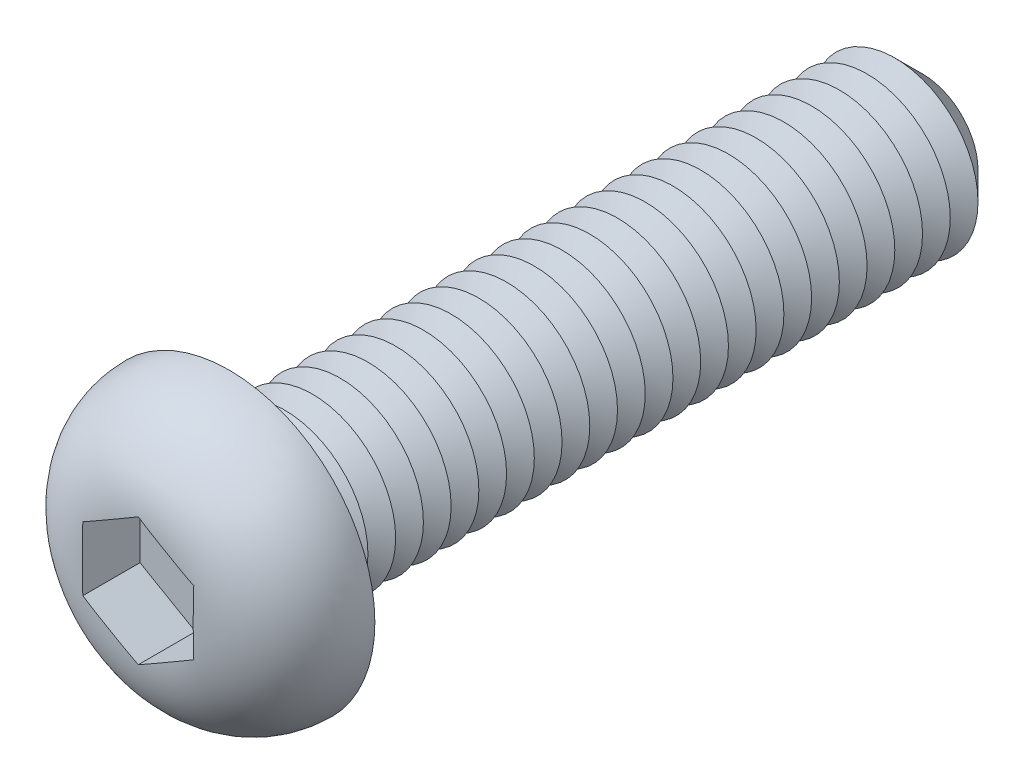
ISO-10303-21;
HEADER;
FILE_DESCRIPTION(('STEP AP214'),'2;1');
FILE_NAME('part.step','',(''),(''),'','','');
FILE_SCHEMA(('AUTOMOTIVE_DESIGN { 1 0 10303 214 1 1 1 1 }'));
ENDSEC;
DATA;
#1=APPLICATION_CONTEXT('core data for automotive mechanical design processes');
#2=APPLICATION_PROTOCOL_DEFINITION('international standard','automotive_design',2000,#1);
#3=PRODUCT_CONTEXT('',#1,'mechanical');
#4=PRODUCT('Part','Part','',(#3));
#5=PRODUCT_RELATED_PRODUCT_CATEGORY('part','',(#4));
#6=PRODUCT_DEFINITION_FORMATION('','',#4);
#7=PRODUCT_DEFINITION_CONTEXT('part definition',#1,'design');
#8=PRODUCT_DEFINITION('design','',#6,#7);
#9=PRODUCT_DEFINITION_SHAPE('','',#8);
#10=(LENGTH_UNIT() NAMED_UNIT(*) SI_UNIT(.MILLI.,.METRE.));
#11=(NAMED_UNIT(*) PLANE_ANGLE_UNIT() SI_UNIT($,.RADIAN.));
#12=(NAMED_UNIT(*) SI_UNIT($,.STERADIAN.) SOLID_ANGLE_UNIT());
#13=UNCERTAINTY_MEASURE_WITH_UNIT(LENGTH_MEASURE(1.E-05),#10,'distance_accuracy_value','');
#14=(GEOMETRIC_REPRESENTATION_CONTEXT(3) GLOBAL_UNCERTAINTY_ASSIGNED_CONTEXT((#13)) GLOBAL_UNIT_ASSIGNED_CONTEXT((#10,
#11,#12)) REPRESENTATION_CONTEXT('',''));
#15=CARTESIAN_POINT('',(0.,0.,0.));
#16=DIRECTION('',(0.,0.,1.));
#17=DIRECTION('',(1.,0.,0.));
#18=AXIS2_PLACEMENT_3D('',#15,#16,#17);
#19=CARTESIAN_POINT('',(0.,0.,-25.));
#20=DIRECTION('',(0.,0.,1.));
#21=DIRECTION('',(1.,0.,0.));
#22=AXIS2_PLACEMENT_3D('',#19,#20,#21);
#23=CYLINDRICAL_SURFACE('',#22,3.);
#24=CARTESIAN_POINT('',(0.,0.,-0.5));
#25=DIRECTION('',(0.,0.,1.));
#26=DIRECTION('',(1.,0.,0.));
#27=AXIS2_PLACEMENT_3D('',#24,#25,#26);
#28=CIRCLE('',#27,3.);
#29=CARTESIAN_POINT('',(3.,0.,-0.5));
#30=VERTEX_POINT('',#29);
#31=EDGE_CURVE('E47',#30,#30,#28,.F.);
#32=ORIENTED_EDGE('',*,*,#31,.T.);
#33=EDGE_LOOP('',(#32));
#34=FACE_BOUND('',#33,.T.);
#35=CARTESIAN_POINT('',(0.,0.,-1.));
#36=DIRECTION('',(0.,0.,1.));
#37=DIRECTION('',(1.,0.,0.));
#38=AXIS2_PLACEMENT_3D('',#35,#36,#37);
#39=CIRCLE('',#38,3.);
#40=CARTESIAN_POINT('',(3.,0.,-1.));
#41=VERTEX_POINT('',#40);
#42=EDGE_CURVE('E117',#41,#41,#39,.T.);
#43=ORIENTED_EDGE('',*,*,#42,.T.);
#44=EDGE_LOOP('',(#43));
#45=FACE_BOUND('',#44,.T.);
#46=ADVANCED_FACE('F38',(#34,#45),#23,.T.);
#47=CARTESIAN_POINT('',(0.,5.25,0.));
#48=DIRECTION('',(0.,0.,1.));
#49=DIRECTION('',(1.,0.,0.));
#50=AXIS2_PLACEMENT_3D('',#47,#48,#49);
#51=PLANE('',#50);
#52=CARTESIAN_POINT('',(0.,0.,0.));
#53=DIRECTION('',(0.,0.,1.));
#54=DIRECTION('',(1.,0.,0.));
#55=AXIS2_PLACEMENT_3D('',#52,#53,#54);
#56=CIRCLE('',#55,3.5);
#57=CARTESIAN_POINT('',(3.5,0.,0.));
#58=VERTEX_POINT('',#57);
#59=EDGE_CURVE('E11',#58,#58,#56,.T.);
#60=ORIENTED_EDGE('',*,*,#59,.T.);
#61=EDGE_LOOP('',(#60));
#62=FACE_BOUND('',#61,.T.);
#63=CARTESIAN_POINT('',(0.,0.,0.));
#64=DIRECTION('',(0.,0.,1.));
#65=DIRECTION('',(1.,0.,0.));
#66=AXIS2_PLACEMENT_3D('',#63,#64,#65);
#67=CIRCLE('',#66,5.25);
#68=CARTESIAN_POINT('',(5.25,0.,0.));
#69=VERTEX_POINT('',#68);
#70=EDGE_CURVE('E141',#69,#69,#67,.T.);
#71=ORIENTED_EDGE('',*,*,#70,.F.);
#72=EDGE_LOOP('',(#71));
#73=FACE_BOUND('',#72,.T.);
#74=ADVANCED_FACE('F218',(#62,#73),#51,.F.);
#75=CARTESIAN_POINT('',(0.,0.,0.));
#76=DIRECTION('',(0.,0.,1.));
#77=DIRECTION('',(1.,0.,0.));
#78=AXIS2_PLACEMENT_3D('',#75,#76,#77);
#79=DEGENERATE_TOROIDAL_SURFACE('',#78,1.95,3.3,.T.);
#80=CARTESIAN_POINT('',(-2.0002,1.15458506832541,3.28035788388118));
#81=CARTESIAN_POINT('',(-1.91691288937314,1.20267090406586,3.28561413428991));
#82=CARTESIAN_POINT('',(-1.83357497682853,1.25078607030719,3.2893341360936));
#83=CARTESIAN_POINT('',(-1.66686712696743,1.34703489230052,3.29467873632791));
#84=CARTESIAN_POINT('',(-1.58349720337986,1.39516854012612,3.29630387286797));
#85=CARTESIAN_POINT('',(-1.4167768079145,1.49142460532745,3.29843721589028));
#86=CARTESIAN_POINT('',(-1.33342633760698,1.53954702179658,3.29894575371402));
#87=CARTESIAN_POINT('',(-1.16671724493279,1.63579656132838,3.29953775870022));
#88=CARTESIAN_POINT('',(-1.0833586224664,1.68392368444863,3.29962119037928));
#89=CARTESIAN_POINT('',(-0.916641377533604,1.78017793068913,3.29962119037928));
#90=CARTESIAN_POINT('',(-0.833282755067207,1.82830505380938,3.29953775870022));
#91=CARTESIAN_POINT('',(-0.666573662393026,1.92455459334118,3.29894575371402));
#92=CARTESIAN_POINT('',(-0.583223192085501,1.97267700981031,3.29843721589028));
#93=CARTESIAN_POINT('',(-0.416502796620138,2.06893307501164,3.29630387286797));
#94=CARTESIAN_POINT('',(-0.333132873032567,2.11706672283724,3.29467873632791));
#95=CARTESIAN_POINT('',(-0.166425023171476,2.21331554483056,3.2893341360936));
#96=CARTESIAN_POINT('',(-0.0830871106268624,2.2614307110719,3.28561413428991));
#97=CARTESIAN_POINT('',(0.000199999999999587,2.30951654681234,3.28035788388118));
#98=B_SPLINE_CURVE_WITH_KNOTS('',3,(#80,#81,#82,#83,#84,#85,#86,#87,#88,#89,#90,#91,#92,#93,#94,
#95,#96,#97),.UNSPECIFIED.,.F.,.F.,(4,2,2,2,2,2,2,2,4),(0.,0.288898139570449,0.577722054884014,
0.866460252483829,1.15522255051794,1.44398484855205,1.73272304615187,2.02154696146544,
2.31044510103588),.UNSPECIFIED.);
#99=CARTESIAN_POINT('',(-2.,1.15470053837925,3.28037053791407));
#100=VERTEX_POINT('',#99);
#101=CARTESIAN_POINT('',(0.,2.3094010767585,3.28037053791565));
#102=VERTEX_POINT('',#101);
#103=EDGE_CURVE('E158',#100,#102,#98,.T.);
#104=ORIENTED_EDGE('',*,*,#103,.T.);
#105=CARTESIAN_POINT('',(-0.000199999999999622,2.30951654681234,3.28035788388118));
#106=CARTESIAN_POINT('',(0.0830871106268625,2.2614307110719,3.28561413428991));
#107=CARTESIAN_POINT('',(0.166425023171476,2.21331554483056,3.2893341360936));
#108=CARTESIAN_POINT('',(0.333132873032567,2.11706672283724,3.29467873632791));
#109=CARTESIAN_POINT('',(0.416502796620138,2.06893307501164,3.29630387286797));
#110=CARTESIAN_POINT('',(0.5832231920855,1.97267700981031,3.29843721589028));
#111=CARTESIAN_POINT('',(0.666573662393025,1.92455459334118,3.29894575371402));
#112=CARTESIAN_POINT('',(0.833282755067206,1.82830505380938,3.29953775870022));
#113=CARTESIAN_POINT('',(0.916641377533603,1.78017793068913,3.29962119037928));
#114=CARTESIAN_POINT('',(1.0833586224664,1.68392368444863,3.29962119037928));
#115=CARTESIAN_POINT('',(1.16671724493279,1.63579656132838,3.29953775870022));
#116=CARTESIAN_POINT('',(1.33342633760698,1.53954702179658,3.29894575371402));
#117=CARTESIAN_POINT('',(1.4167768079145,1.49142460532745,3.29843721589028));
#118=CARTESIAN_POINT('',(1.58349720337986,1.39516854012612,3.29630387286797));
#119=CARTESIAN_POINT('',(1.66686712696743,1.34703489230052,3.29467873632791));
#120=CARTESIAN_POINT('',(1.83357497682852,1.25078607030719,3.2893341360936));
#121=CARTESIAN_POINT('',(1.91691288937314,1.20267090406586,3.28561413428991));
#122=CARTESIAN_POINT('',(2.0002,1.15458506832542,3.28035788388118));
#123=B_SPLINE_CURVE_WITH_KNOTS('',3,(#105,#106,#107,#108,#109,#110,#111,#112,#113,#114,#115,
#116,#117,#118,#119,#120,#121,#122),.UNSPECIFIED.,.F.,.F.,(4,2,2,2,2,2,2,2,4),(0.,
0.288898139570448,0.577722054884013,0.866460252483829,1.15522255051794,1.44398484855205,
1.73272304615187,2.02154696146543,2.31044510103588),.UNSPECIFIED.);
#124=CARTESIAN_POINT('',(2.,1.15470053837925,3.28037053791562));
#125=VERTEX_POINT('',#124);
#126=EDGE_CURVE('E97',#102,#125,#123,.T.);
#127=ORIENTED_EDGE('',*,*,#126,.T.);
#128=CARTESIAN_POINT('',(2.,0.,3.29962119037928));
#129=CARTESIAN_POINT('',(2.,-0.0837769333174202,3.29962202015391));
#130=CARTESIAN_POINT('',(2.,-0.167553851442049,3.29955399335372));
#131=CARTESIAN_POINT('',(2.,-0.335108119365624,3.29913665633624));
#132=CARTESIAN_POINT('',(2.,-0.418885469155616,3.29878734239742));
#133=CARTESIAN_POINT('',(2.,-0.586474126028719,3.29739645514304));
#134=CARTESIAN_POINT('',(2.,-0.670285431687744,3.29635457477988));
#135=CARTESIAN_POINT('',(2.,-0.837881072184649,3.29299045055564));
#136=CARTESIAN_POINT('',(2.,-0.921665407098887,3.29066821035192));
#137=CARTESIAN_POINT('',(2.,-1.1722454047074,3.2807858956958));
#138=CARTESIAN_POINT('',(2.,-1.33895832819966,3.27031526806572));
#139=CARTESIAN_POINT('',(2.,-1.67103623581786,3.23635494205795));
#140=CARTESIAN_POINT('',(2.,-1.83640244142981,3.21287879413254));
#141=CARTESIAN_POINT('',(2.,-2.10344176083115,3.16074182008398));
#142=CARTESIAN_POINT('',(2.,-2.2061099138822,3.13718731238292));
#143=CARTESIAN_POINT('',(2.,-2.40948794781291,3.08263206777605));
#144=CARTESIAN_POINT('',(2.,-2.51019754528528,3.05163026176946));
#145=CARTESIAN_POINT('',(2.,-2.70894468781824,2.98167613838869));
#146=CARTESIAN_POINT('',(2.,-2.80697949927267,2.94271600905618));
#147=CARTESIAN_POINT('',(2.,-2.9994014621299,2.85662314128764));
#148=CARTESIAN_POINT('',(2.,-3.09378880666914,2.80949083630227));
#149=CARTESIAN_POINT('',(2.,-3.27874879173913,2.70660110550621));
#150=CARTESIAN_POINT('',(2.,-3.36928473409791,2.6507774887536));
#151=CARTESIAN_POINT('',(2.,-3.54476824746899,2.53095107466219));
#152=CARTESIAN_POINT('',(2.,-3.6297163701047,2.46694908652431));
#153=CARTESIAN_POINT('',(2.,-3.79309021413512,2.33110056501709));
#154=CARTESIAN_POINT('',(2.,-3.87151694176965,2.25925524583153));
#155=CARTESIAN_POINT('',(2.,-4.02093628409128,2.10826339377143));
#156=CARTESIAN_POINT('',(2.,-4.09192987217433,2.02911781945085));
#157=CARTESIAN_POINT('',(2.,-4.27732278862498,1.8003635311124));
#158=CARTESIAN_POINT('',(2.,-4.38297261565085,1.64348590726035));
#159=CARTESIAN_POINT('',(2.,-4.564185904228,1.31336862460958));
#160=CARTESIAN_POINT('',(2.,-4.63976443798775,1.14013721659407));
#161=CARTESIAN_POINT('',(2.,-4.75417820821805,0.794488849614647));
#162=CARTESIAN_POINT('',(2.,-4.79509243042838,0.622758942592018));
#163=CARTESIAN_POINT('',(2.,-4.84679751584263,0.274828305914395));
#164=CARTESIAN_POINT('',(2.,-4.85759267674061,0.0986282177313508));
#165=CARTESIAN_POINT('',(2.,-4.8487955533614,-0.249157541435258));
#166=CARTESIAN_POINT('',(2.,-4.82985906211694,-0.42076022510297));
#167=CARTESIAN_POINT('',(2.,-4.76345103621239,-0.758322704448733));
#168=CARTESIAN_POINT('',(2.,-4.71598351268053,-0.924283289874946));
#169=CARTESIAN_POINT('',(2.,-4.59404942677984,-1.24604183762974));
#170=CARTESIAN_POINT('',(2.,-4.51956988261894,-1.40183487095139));
#171=CARTESIAN_POINT('',(2.,-4.34600859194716,-1.6990817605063));
#172=CARTESIAN_POINT('',(2.,-4.24691988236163,-1.84053154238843));
#173=CARTESIAN_POINT('',(2.,-4.02493220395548,-2.10847549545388));
#174=CARTESIAN_POINT('',(2.,-3.90156532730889,-2.23458080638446));
#175=CARTESIAN_POINT('',(2.,-3.63636218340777,-2.46550695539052));
#176=CARTESIAN_POINT('',(2.,-3.49453117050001,-2.57033382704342));
#177=CARTESIAN_POINT('',(2.,-3.26713798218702,-2.7130834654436));
#178=CARTESIAN_POINT('',(2.,-3.18660091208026,-2.75923686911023));
#179=CARTESIAN_POINT('',(2.,-3.02216370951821,-2.84520816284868));
#180=CARTESIAN_POINT('',(2.,-2.93826250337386,-2.88502400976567));
#181=CARTESIAN_POINT('',(2.,-2.76779132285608,-2.95832456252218));
#182=CARTESIAN_POINT('',(2.,-2.68122238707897,-2.99181169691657));
#183=CARTESIAN_POINT('',(2.,-2.50604626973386,-3.05263810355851));
#184=CARTESIAN_POINT('',(2.,-2.41744088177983,-3.07998257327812));
#185=CARTESIAN_POINT('',(2.,-2.20396420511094,-3.13835394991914));
#186=CARTESIAN_POINT('',(2.,-2.0783565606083,-3.16669536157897));
#187=CARTESIAN_POINT('',(2.,-1.82529007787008,-3.2134938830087));
#188=CARTESIAN_POINT('',(2.,-1.69783012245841,-3.23194474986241));
#189=CARTESIAN_POINT('',(2.,-1.44149598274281,-3.26083645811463));
#190=CARTESIAN_POINT('',(2.,-1.31261808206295,-3.27124272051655));
#191=CARTESIAN_POINT('',(2.,-1.05456848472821,-3.28623769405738));
#192=CARTESIAN_POINT('',(2.,-0.925396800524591,-3.29082664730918));
#193=CARTESIAN_POINT('',(2.,-0.665550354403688,-3.29674923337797));
#194=CARTESIAN_POINT('',(2.,-0.534874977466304,-3.29804579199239));
#195=CARTESIAN_POINT('',(2.,-0.273526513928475,-3.29947536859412));
#196=CARTESIAN_POINT('',(2.,-0.142853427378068,-3.29960842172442));
#197=CARTESIAN_POINT('',(2.,0.11824331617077,-3.29963281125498));
#198=CARTESIAN_POINT('',(2.,0.248666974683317,-3.29952460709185));
#199=CARTESIAN_POINT('',(2.,0.509509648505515,-3.29825409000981));
#200=CARTESIAN_POINT('',(2.,0.639928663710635,-3.29709183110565));
#201=CARTESIAN_POINT('',(2.,0.83173045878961,-3.29304171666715));
#202=CARTESIAN_POINT('',(2.,0.893136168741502,-3.29139197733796));
#203=CARTESIAN_POINT('',(2.,1.01591282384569,-3.28711504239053));
#204=CARTESIAN_POINT('',(2.,1.07728376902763,-3.28448784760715));
#205=CARTESIAN_POINT('',(2.,1.26131335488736,-3.27473407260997));
#206=CARTESIAN_POINT('',(2.,1.38388698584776,-3.2657353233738));
#207=CARTESIAN_POINT('',(2.,1.62750125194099,-3.24079239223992));
#208=CARTESIAN_POINT('',(2.,1.74854662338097,-3.22489680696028));
#209=CARTESIAN_POINT('',(2.,1.98924449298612,-3.18452451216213));
#210=CARTESIAN_POINT('',(2.,2.10889688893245,-3.16004717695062));
#211=CARTESIAN_POINT('',(2.,2.34827145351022,-3.10067973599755));
#212=CARTESIAN_POINT('',(2.,2.46794336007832,-3.06558373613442));
#213=CARTESIAN_POINT('',(2.,2.70350765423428,-2.98433995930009));
#214=CARTESIAN_POINT('',(2.,2.81940009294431,-2.93819233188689));
#215=CARTESIAN_POINT('',(2.,3.0462872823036,-2.83430045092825));
#216=CARTESIAN_POINT('',(2.,3.157267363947,-2.77652399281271));
#217=CARTESIAN_POINT('',(2.,3.37244069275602,-2.64945989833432));
#218=CARTESIAN_POINT('',(2.,3.47663511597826,-2.58017426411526));
#219=CARTESIAN_POINT('',(2.,3.66184410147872,-2.44158969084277));
#220=CARTESIAN_POINT('',(2.,3.74400419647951,-2.37381785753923));
#221=CARTESIAN_POINT('',(2.,3.90136233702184,-2.23063102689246));
#222=CARTESIAN_POINT('',(2.,3.9765614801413,-2.1552172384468));
#223=CARTESIAN_POINT('',(2.,4.11902811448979,-1.99742327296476));
#224=CARTESIAN_POINT('',(2.,4.1863071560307,-1.91505354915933));
#225=CARTESIAN_POINT('',(2.,4.31224227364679,-1.74401295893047));
#226=CARTESIAN_POINT('',(2.,4.37089943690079,-1.65534288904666));
#227=CARTESIAN_POINT('',(2.,4.51742320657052,-1.40720395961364));
#228=CARTESIAN_POINT('',(2.,4.59632371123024,-1.24230503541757));
#229=CARTESIAN_POINT('',(2.,4.72377654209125,-0.901269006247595));
#230=CARTESIAN_POINT('',(2.,4.77233626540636,-0.725134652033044));
#231=CARTESIAN_POINT('',(2.,4.83594291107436,-0.37516230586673));
#232=CARTESIAN_POINT('',(2.,4.85240855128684,-0.201581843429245));
#233=CARTESIAN_POINT('',(2.,4.85558073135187,0.14583509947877));
#234=CARTESIAN_POINT('',(2.,4.8422910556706,0.319671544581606));
#235=CARTESIAN_POINT('',(2.,4.78674180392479,0.660539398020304));
#236=CARTESIAN_POINT('',(2.,4.74482430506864,0.82762675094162));
#237=CARTESIAN_POINT('',(2.,4.63375789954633,1.15246461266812));
#238=CARTESIAN_POINT('',(2.,4.56461058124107,1.31021566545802));
#239=CARTESIAN_POINT('',(2.,4.40063624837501,1.61344814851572));
#240=CARTESIAN_POINT('',(2.,4.30559842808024,1.75881539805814));
#241=CARTESIAN_POINT('',(2.,4.09315528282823,2.03216183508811));
#242=CARTESIAN_POINT('',(2.,3.97574503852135,2.16013718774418));
#243=CARTESIAN_POINT('',(2.,3.71810418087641,2.39975271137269));
#244=CARTESIAN_POINT('',(2.,3.57725563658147,2.51072635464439));
#245=CARTESIAN_POINT('',(2.,3.28005668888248,2.70933274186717));
#246=CARTESIAN_POINT('',(2.,3.12370896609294,2.79696951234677));
#247=CARTESIAN_POINT('',(2.,2.85462284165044,2.92305372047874));
#248=CARTESIAN_POINT('',(2.,2.74490899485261,2.96813077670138));
#249=CARTESIAN_POINT('',(2.,2.52184151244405,3.04824715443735));
#250=CARTESIAN_POINT('',(2.,2.40848685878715,3.08328364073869));
#251=CARTESIAN_POINT('',(2.,2.17918323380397,3.14397693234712));
#252=CARTESIAN_POINT('',(2.,2.06323128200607,3.16962230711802));
#253=CARTESIAN_POINT('',(2.,1.82982653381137,3.21251895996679));
#254=CARTESIAN_POINT('',(2.,1.71237385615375,3.229770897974));
#255=CARTESIAN_POINT('',(2.,1.46252543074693,3.2589582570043));
#256=CARTESIAN_POINT('',(2.,1.33002988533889,3.27000580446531));
#257=CARTESIAN_POINT('',(2.,1.0646774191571,3.28585371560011));
#258=CARTESIAN_POINT('',(2.,0.931820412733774,3.29065244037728));
#259=CARTESIAN_POINT('',(2.,0.665789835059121,3.29677132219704));
#260=CARTESIAN_POINT('',(2.,0.532616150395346,3.29808470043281));
#261=CARTESIAN_POINT('',(2.,0.332868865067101,3.29913679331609));
#262=CARTESIAN_POINT('',(2.,0.266295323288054,3.2993345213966));
#263=CARTESIAN_POINT('',(2.,0.133147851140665,3.29957639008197));
#264=CARTESIAN_POINT('',(2.,0.0665739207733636,3.29962053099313));
#265=CARTESIAN_POINT('',(2.,0.,3.29962119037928));
#266=B_SPLINE_CURVE_WITH_KNOTS('',3,(#128,#129,#130,#131,#132,#133,#134,#135,#136,#137,#138,
#139,#140,#141,#142,#143,#144,#145,#146,#147,#148,#149,#150,#151,#152,#153,#154,#155,#156,#157,
#158,#159,#160,#161,#162,#163,#164,#165,#166,#167,#168,#169,#170,#171,#172,#173,#174,#175,#176,
#177,#178,#179,#180,#181,#182,#183,#184,#185,#186,#187,#188,#189,#190,#191,#192,#193,#194,#195,
#196,#197,#198,#199,#200,#201,#202,#203,#204,#205,#206,#207,#208,#209,#210,#211,#212,#213,#214,
#215,#216,#217,#218,#219,#220,#221,#222,#223,#224,#225,#226,#227,#228,#229,#230,#231,#232,#233,
#234,#235,#236,#237,#238,#239,#240,#241,#242,#243,#244,#245,#246,#247,#248,#249,#250,#251,#252,
#253,#254,#255,#256,#257,#258,#259,#260,#261,#262,#263,#264,#265),.UNSPECIFIED.,.T.,.F.,(4,2,2,
2,2,2,2,2,2,2,2,2,2,2,2,2,2,2,2,2,2,2,2,2,2,2,2,2,2,2,2,2,2,2,2,2,2,2,2,2,2,2,2,2,2,2,2,2,2,2,2,
2,2,2,2,2,2,2,2,2,2,2,2,2,2,2,2,2,4),(0.,0.251330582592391,0.502664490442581,0.754109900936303,
1.00555459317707,1.50637447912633,2.00667353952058,2.32243701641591,2.63824585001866,
2.95436618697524,3.27046976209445,3.58911045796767,3.90771965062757,4.22627959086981,
4.5447977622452,5.10896009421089,5.67283930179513,6.19985685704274,6.72679920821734,
7.24228104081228,7.75769041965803,8.27334782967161,8.78915130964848,9.3160918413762,
9.84288274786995,10.1211212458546,10.3994492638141,10.6776702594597,10.9556549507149,
11.3414617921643,11.727511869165,12.1152122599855,12.5028965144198,12.8949273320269,
13.2869463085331,13.6782193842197,14.0694724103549,14.2537488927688,14.4380252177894,
14.8065831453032,15.1725852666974,15.5386140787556,15.9122523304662,16.28588552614,
16.6605680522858,17.0351854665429,17.3542226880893,17.6732095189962,17.9917252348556,
18.3102007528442,18.8555909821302,19.4008481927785,19.9214008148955,20.4418872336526,
20.9562606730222,21.4706041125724,21.9892675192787,22.5080451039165,23.0436926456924,
23.5792477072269,23.9346277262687,24.2901079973,24.6460195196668,25.0019030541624,
25.4005476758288,25.7992968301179,26.1988209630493,26.3985429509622,26.5982645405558),.UNSPECIFIED.);
#267=CARTESIAN_POINT('',(2.,-1.15470053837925,3.28037053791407));
#268=VERTEX_POINT('',#267);
#269=EDGE_CURVE('E62',#125,#268,#266,.T.);
#270=ORIENTED_EDGE('',*,*,#269,.T.);
#271=CARTESIAN_POINT('',(2.0002,-1.15458506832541,3.28035788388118));
#272=CARTESIAN_POINT('',(1.91691288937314,-1.20267090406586,3.28561413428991));
#273=CARTESIAN_POINT('',(1.83357497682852,-1.25078607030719,3.2893341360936));
#274=CARTESIAN_POINT('',(1.66686712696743,-1.34703489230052,3.29467873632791));
#275=CARTESIAN_POINT('',(1.58349720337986,-1.39516854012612,3.29630387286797));
#276=CARTESIAN_POINT('',(1.4167768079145,-1.49142460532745,3.29843721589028));
#277=CARTESIAN_POINT('',(1.33342633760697,-1.53954702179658,3.29894575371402));
#278=CARTESIAN_POINT('',(1.16671724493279,-1.63579656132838,3.29953775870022));
#279=CARTESIAN_POINT('',(1.0833586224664,-1.68392368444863,3.29962119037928));
#280=CARTESIAN_POINT('',(0.916641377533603,-1.78017793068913,3.29962119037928));
#281=CARTESIAN_POINT('',(0.833282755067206,-1.82830505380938,3.29953775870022));
#282=CARTESIAN_POINT('',(0.666573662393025,-1.92455459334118,3.29894575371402));
#283=CARTESIAN_POINT('',(0.5832231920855,-1.97267700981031,3.29843721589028));
#284=CARTESIAN_POINT('',(0.416502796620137,-2.06893307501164,3.29630387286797));
#285=CARTESIAN_POINT('',(0.333132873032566,-2.11706672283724,3.29467873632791));
#286=CARTESIAN_POINT('',(0.166425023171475,-2.21331554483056,3.2893341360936));
#287=CARTESIAN_POINT('',(0.0830871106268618,-2.2614307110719,3.28561413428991));
#288=CARTESIAN_POINT('',(-0.000200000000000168,-2.30951654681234,3.28035788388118));
#289=B_SPLINE_CURVE_WITH_KNOTS('',3,(#271,#272,#273,#274,#275,#276,#277,#278,#279,#280,#281,
#282,#283,#284,#285,#286,#287,#288),.UNSPECIFIED.,.F.,.F.,(4,2,2,2,2,2,2,2,4),(0.,
0.288898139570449,0.577722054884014,0.866460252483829,1.15522255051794,1.44398484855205,
1.73272304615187,2.02154696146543,2.31044510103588),.UNSPECIFIED.);
#290=CARTESIAN_POINT('',(0.,-2.3094010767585,3.28037053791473));
#291=VERTEX_POINT('',#290);
#292=EDGE_CURVE('E239',#268,#291,#289,.T.);
#293=ORIENTED_EDGE('',*,*,#292,.T.);
#294=CARTESIAN_POINT('',(0.000199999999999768,-2.30951654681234,3.28035788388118));
#295=CARTESIAN_POINT('',(-0.0830871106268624,-2.2614307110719,3.28561413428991));
#296=CARTESIAN_POINT('',(-0.166425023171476,-2.21331554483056,3.2893341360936));
#297=CARTESIAN_POINT('',(-0.333132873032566,-2.11706672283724,3.29467873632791));
#298=CARTESIAN_POINT('',(-0.416502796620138,-2.06893307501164,3.29630387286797));
#299=CARTESIAN_POINT('',(-0.5832231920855,-1.97267700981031,3.29843721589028));
#300=CARTESIAN_POINT('',(-0.666573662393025,-1.92455459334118,3.29894575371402));
#301=CARTESIAN_POINT('',(-0.833282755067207,-1.82830505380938,3.29953775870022));
#302=CARTESIAN_POINT('',(-0.916641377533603,-1.78017793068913,3.29962119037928));
#303=CARTESIAN_POINT('',(-1.0833586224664,-1.68392368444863,3.29962119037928));
#304=CARTESIAN_POINT('',(-1.16671724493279,-1.63579656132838,3.29953775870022));
#305=CARTESIAN_POINT('',(-1.33342633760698,-1.53954702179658,3.29894575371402));
#306=CARTESIAN_POINT('',(-1.4167768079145,-1.49142460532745,3.29843721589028));
#307=CARTESIAN_POINT('',(-1.58349720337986,-1.39516854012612,3.29630387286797));
#308=CARTESIAN_POINT('',(-1.66686712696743,-1.34703489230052,3.29467873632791));
#309=CARTESIAN_POINT('',(-1.83357497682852,-1.25078607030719,3.2893341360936));
#310=CARTESIAN_POINT('',(-1.91691288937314,-1.20267090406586,3.28561413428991));
#311=CARTESIAN_POINT('',(-2.0002,-1.15458506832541,3.28035788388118));
#312=B_SPLINE_CURVE_WITH_KNOTS('',3,(#294,#295,#296,#297,#298,#299,#300,#301,#302,#303,#304,
#305,#306,#307,#308,#309,#310,#311),.UNSPECIFIED.,.F.,.F.,(4,2,2,2,2,2,2,2,4),(0.,
0.288898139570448,0.577722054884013,0.866460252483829,1.15522255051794,1.44398484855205,
1.73272304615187,2.02154696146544,2.31044510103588),.UNSPECIFIED.);
#313=CARTESIAN_POINT('',(-2.,-1.15470053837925,3.28037053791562));
#314=VERTEX_POINT('',#313);
#315=EDGE_CURVE('E245',#291,#314,#312,.T.);
#316=ORIENTED_EDGE('',*,*,#315,.T.);
#317=CARTESIAN_POINT('',(-2.,0.,3.29962119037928));
#318=CARTESIAN_POINT('',(-2.,0.0837769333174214,3.29962202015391));
#319=CARTESIAN_POINT('',(-2.,0.167553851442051,3.29955399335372));
#320=CARTESIAN_POINT('',(-2.,0.335108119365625,3.29913665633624));
#321=CARTESIAN_POINT('',(-2.,0.418885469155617,3.29878734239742));
#322=CARTESIAN_POINT('',(-2.,0.586474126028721,3.29739645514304));
#323=CARTESIAN_POINT('',(-2.,0.670285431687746,3.29635457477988));
#324=CARTESIAN_POINT('',(-2.,0.837881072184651,3.29299045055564));
#325=CARTESIAN_POINT('',(-2.,0.921665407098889,3.29066821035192));
#326=CARTESIAN_POINT('',(-2.,1.1722454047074,3.2807858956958));
#327=CARTESIAN_POINT('',(-2.,1.33895832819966,3.27031526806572));
#328=CARTESIAN_POINT('',(-2.,1.67103623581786,3.23635494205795));
#329=CARTESIAN_POINT('',(-2.,1.83640244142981,3.21287879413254));
#330=CARTESIAN_POINT('',(-2.,2.10344176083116,3.16074182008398));
#331=CARTESIAN_POINT('',(-2.,2.20610991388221,3.13718731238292));
#332=CARTESIAN_POINT('',(-2.,2.40948794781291,3.08263206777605));
#333=CARTESIAN_POINT('',(-2.,2.51019754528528,3.05163026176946));
#334=CARTESIAN_POINT('',(-2.,2.70894468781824,2.98167613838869));
#335=CARTESIAN_POINT('',(-2.,2.80697949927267,2.94271600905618));
#336=CARTESIAN_POINT('',(-2.,2.9994014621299,2.85662314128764));
#337=CARTESIAN_POINT('',(-2.,3.09378880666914,2.80949083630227));
#338=CARTESIAN_POINT('',(-2.,3.27874879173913,2.70660110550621));
#339=CARTESIAN_POINT('',(-2.,3.36928473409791,2.65077748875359));
#340=CARTESIAN_POINT('',(-2.,3.54476824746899,2.53095107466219));
#341=CARTESIAN_POINT('',(-2.,3.6297163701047,2.46694908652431));
#342=CARTESIAN_POINT('',(-2.,3.79309021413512,2.33110056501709));
#343=CARTESIAN_POINT('',(-2.,3.87151694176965,2.25925524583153));
#344=CARTESIAN_POINT('',(-2.,4.02093628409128,2.10826339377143));
#345=CARTESIAN_POINT('',(-2.,4.09192987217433,2.02911781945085));
#346=CARTESIAN_POINT('',(-2.,4.27732278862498,1.8003635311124));
#347=CARTESIAN_POINT('',(-2.,4.38297261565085,1.64348590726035));
#348=CARTESIAN_POINT('',(-2.,4.564185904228,1.31336862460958));
#349=CARTESIAN_POINT('',(-2.,4.63976443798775,1.14013721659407));
#350=CARTESIAN_POINT('',(-2.,4.75417820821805,0.794488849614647));
#351=CARTESIAN_POINT('',(-2.,4.79509243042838,0.622758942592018));
#352=CARTESIAN_POINT('',(-2.,4.84679751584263,0.274828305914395));
#353=CARTESIAN_POINT('',(-2.,4.85759267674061,0.0986282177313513));
#354=CARTESIAN_POINT('',(-2.,4.8487955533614,-0.249157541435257));
#355=CARTESIAN_POINT('',(-2.,4.82985906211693,-0.420760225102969));
#356=CARTESIAN_POINT('',(-2.,4.76345103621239,-0.758322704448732));
#357=CARTESIAN_POINT('',(-2.,4.71598351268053,-0.924283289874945));
#358=CARTESIAN_POINT('',(-2.,4.59404942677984,-1.24604183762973));
#359=CARTESIAN_POINT('',(-2.,4.51956988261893,-1.40183487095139));
#360=CARTESIAN_POINT('',(-2.,4.34600859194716,-1.6990817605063));
#361=CARTESIAN_POINT('',(-2.,4.24691988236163,-1.84053154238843));
#362=CARTESIAN_POINT('',(-2.,4.02493220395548,-2.10847549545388));
#363=CARTESIAN_POINT('',(-2.,3.90156532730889,-2.23458080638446));
#364=CARTESIAN_POINT('',(-2.,3.63636218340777,-2.46550695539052));
#365=CARTESIAN_POINT('',(-2.,3.49453117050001,-2.57033382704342));
#366=CARTESIAN_POINT('',(-2.,3.26713798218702,-2.7130834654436));
#367=CARTESIAN_POINT('',(-2.,3.18660091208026,-2.75923686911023));
#368=CARTESIAN_POINT('',(-2.,3.02216370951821,-2.84520816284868));
#369=CARTESIAN_POINT('',(-2.,2.93826250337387,-2.88502400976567));
#370=CARTESIAN_POINT('',(-2.,2.76779132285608,-2.95832456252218));
#371=CARTESIAN_POINT('',(-2.,2.68122238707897,-2.99181169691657));
#372=CARTESIAN_POINT('',(-2.,2.50604626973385,-3.05263810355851));
#373=CARTESIAN_POINT('',(-2.,2.41744088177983,-3.07998257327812));
#374=CARTESIAN_POINT('',(-2.,2.20396420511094,-3.13835394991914));
#375=CARTESIAN_POINT('',(-2.,2.0783565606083,-3.16669536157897));
#376=CARTESIAN_POINT('',(-2.,1.82529007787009,-3.2134938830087));
#377=CARTESIAN_POINT('',(-2.,1.69783012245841,-3.23194474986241));
#378=CARTESIAN_POINT('',(-2.,1.44149598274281,-3.26083645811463));
#379=CARTESIAN_POINT('',(-2.,1.31261808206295,-3.27124272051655));
#380=CARTESIAN_POINT('',(-2.,1.05456848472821,-3.28623769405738));
#381=CARTESIAN_POINT('',(-2.,0.925396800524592,-3.29082664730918));
#382=CARTESIAN_POINT('',(-2.,0.66555035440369,-3.29674923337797));
#383=CARTESIAN_POINT('',(-2.,0.534874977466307,-3.29804579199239));
#384=CARTESIAN_POINT('',(-2.,0.273526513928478,-3.29947536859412));
#385=CARTESIAN_POINT('',(-2.,0.142853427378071,-3.29960842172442));
#386=CARTESIAN_POINT('',(-2.,-0.118243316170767,-3.29963281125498));
#387=CARTESIAN_POINT('',(-2.,-0.248666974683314,-3.29952460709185));
#388=CARTESIAN_POINT('',(-2.,-0.509509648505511,-3.29825409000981));
#389=CARTESIAN_POINT('',(-2.,-0.639928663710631,-3.29709183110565));
#390=CARTESIAN_POINT('',(-2.,-0.831730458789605,-3.29304171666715));
#391=CARTESIAN_POINT('',(-2.,-0.893136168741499,-3.29139197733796));
#392=CARTESIAN_POINT('',(-2.,-1.01591282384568,-3.28711504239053));
#393=CARTESIAN_POINT('',(-2.,-1.07728376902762,-3.28448784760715));
#394=CARTESIAN_POINT('',(-2.,-1.26131335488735,-3.27473407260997));
#395=CARTESIAN_POINT('',(-2.,-1.38388698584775,-3.2657353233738));
#396=CARTESIAN_POINT('',(-2.,-1.62750125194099,-3.24079239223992));
#397=CARTESIAN_POINT('',(-2.,-1.74854662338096,-3.22489680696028));
#398=CARTESIAN_POINT('',(-2.,-1.98924449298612,-3.18452451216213));
#399=CARTESIAN_POINT('',(-2.,-2.10889688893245,-3.16004717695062));
#400=CARTESIAN_POINT('',(-2.,-2.34827145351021,-3.10067973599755));
#401=CARTESIAN_POINT('',(-2.,-2.46794336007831,-3.06558373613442));
#402=CARTESIAN_POINT('',(-2.,-2.70350765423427,-2.98433995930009));
#403=CARTESIAN_POINT('',(-2.,-2.81940009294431,-2.93819233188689));
#404=CARTESIAN_POINT('',(-2.,-3.0462872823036,-2.83430045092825));
#405=CARTESIAN_POINT('',(-2.,-3.157267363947,-2.77652399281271));
#406=CARTESIAN_POINT('',(-2.,-3.37244069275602,-2.64945989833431));
#407=CARTESIAN_POINT('',(-2.,-3.47663511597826,-2.58017426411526));
#408=CARTESIAN_POINT('',(-2.,-3.66184410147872,-2.44158969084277));
#409=CARTESIAN_POINT('',(-2.,-3.74400419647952,-2.37381785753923));
#410=CARTESIAN_POINT('',(-2.,-3.90136233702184,-2.23063102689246));
#411=CARTESIAN_POINT('',(-2.,-3.9765614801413,-2.1552172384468));
#412=CARTESIAN_POINT('',(-2.,-4.11902811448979,-1.99742327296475));
#413=CARTESIAN_POINT('',(-2.,-4.1863071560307,-1.91505354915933));
#414=CARTESIAN_POINT('',(-2.,-4.31224227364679,-1.74401295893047));
#415=CARTESIAN_POINT('',(-2.,-4.37089943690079,-1.65534288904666));
#416=CARTESIAN_POINT('',(-2.,-4.51742320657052,-1.40720395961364));
#417=CARTESIAN_POINT('',(-2.,-4.59632371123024,-1.24230503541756));
#418=CARTESIAN_POINT('',(-2.,-4.72377654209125,-0.901269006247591));
#419=CARTESIAN_POINT('',(-2.,-4.77233626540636,-0.725134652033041));
#420=CARTESIAN_POINT('',(-2.,-4.83594291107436,-0.375162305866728));
#421=CARTESIAN_POINT('',(-2.,-4.85240855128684,-0.201581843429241));
#422=CARTESIAN_POINT('',(-2.,-4.85558073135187,0.145835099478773));
#423=CARTESIAN_POINT('',(-2.,-4.8422910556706,0.319671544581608));
#424=CARTESIAN_POINT('',(-2.,-4.78674180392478,0.660539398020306));
#425=CARTESIAN_POINT('',(-2.,-4.74482430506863,0.827626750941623));
#426=CARTESIAN_POINT('',(-2.,-4.63375789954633,1.15246461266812));
#427=CARTESIAN_POINT('',(-2.,-4.56461058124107,1.31021566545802));
#428=CARTESIAN_POINT('',(-2.,-4.40063624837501,1.61344814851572));
#429=CARTESIAN_POINT('',(-2.,-4.30559842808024,1.75881539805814));
#430=CARTESIAN_POINT('',(-2.,-4.09315528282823,2.03216183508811));
#431=CARTESIAN_POINT('',(-2.,-3.97574503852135,2.16013718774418));
#432=CARTESIAN_POINT('',(-2.,-3.71810418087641,2.3997527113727));
#433=CARTESIAN_POINT('',(-2.,-3.57725563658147,2.51072635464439));
#434=CARTESIAN_POINT('',(-2.,-3.28005668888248,2.70933274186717));
#435=CARTESIAN_POINT('',(-2.,-3.12370896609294,2.79696951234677));
#436=CARTESIAN_POINT('',(-2.,-2.85462284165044,2.92305372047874));
#437=CARTESIAN_POINT('',(-2.,-2.74490899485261,2.96813077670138));
#438=CARTESIAN_POINT('',(-2.,-2.52184151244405,3.04824715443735));
#439=CARTESIAN_POINT('',(-2.,-2.40848685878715,3.08328364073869));
#440=CARTESIAN_POINT('',(-2.,-2.17918323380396,3.14397693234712));
#441=CARTESIAN_POINT('',(-2.,-2.06323128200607,3.16962230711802));
#442=CARTESIAN_POINT('',(-2.,-1.82982653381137,3.21251895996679));
#443=CARTESIAN_POINT('',(-2.,-1.71237385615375,3.229770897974));
#444=CARTESIAN_POINT('',(-2.,-1.46252543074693,3.2589582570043));
#445=CARTESIAN_POINT('',(-2.,-1.33002988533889,3.27000580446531));
#446=CARTESIAN_POINT('',(-2.,-1.0646774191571,3.28585371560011));
#447=CARTESIAN_POINT('',(-2.,-0.931820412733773,3.29065244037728));
#448=CARTESIAN_POINT('',(-2.,-0.66578983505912,3.29677132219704));
#449=CARTESIAN_POINT('',(-2.,-0.532616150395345,3.29808470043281));
#450=CARTESIAN_POINT('',(-2.,-0.3328688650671,3.29913679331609));
#451=CARTESIAN_POINT('',(-2.,-0.266295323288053,3.2993345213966));
#452=CARTESIAN_POINT('',(-2.,-0.133147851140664,3.29957639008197));
#453=CARTESIAN_POINT('',(-2.,-0.0665739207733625,3.29962053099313));
#454=CARTESIAN_POINT('',(-2.,0.,3.29962119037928));
#455=B_SPLINE_CURVE_WITH_KNOTS('',3,(#317,#318,#319,#320,#321,#322,#323,#324,#325,#326,#327,
#328,#329,#330,#331,#332,#333,#334,#335,#336,#337,#338,#339,#340,#341,#342,#343,#344,#345,#346,
#347,#348,#349,#350,#351,#352,#353,#354,#355,#356,#357,#358,#359,#360,#361,#362,#363,#364,#365,
#366,#367,#368,#369,#370,#371,#372,#373,#374,#375,#376,#377,#378,#379,#380,#381,#382,#383,#384,
#385,#386,#387,#388,#389,#390,#391,#392,#393,#394,#395,#396,#397,#398,#399,#400,#401,#402,#403,
#404,#405,#406,#407,#408,#409,#410,#411,#412,#413,#414,#415,#416,#417,#418,#419,#420,#421,#422,
#423,#424,#425,#426,#427,#428,#429,#430,#431,#432,#433,#434,#435,#436,#437,#438,#439,#440,#441,
#442,#443,#444,#445,#446,#447,#448,#449,#450,#451,#452,#453,#454),.UNSPECIFIED.,.T.,.F.,(4,2,2,
2,2,2,2,2,2,2,2,2,2,2,2,2,2,2,2,2,2,2,2,2,2,2,2,2,2,2,2,2,2,2,2,2,2,2,2,2,2,2,2,2,2,2,2,2,2,2,2,
2,2,2,2,2,2,2,2,2,2,2,2,2,2,2,2,2,4),(0.,0.251330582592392,0.502664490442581,0.754109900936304,
1.00555459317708,1.50637447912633,2.00667353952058,2.32243701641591,2.63824585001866,
2.95436618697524,3.27046976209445,3.58911045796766,3.90771965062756,4.22627959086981,
4.5447977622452,5.10896009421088,5.67283930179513,6.19985685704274,6.72679920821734,
7.24228104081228,7.75769041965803,8.27334782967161,8.78915130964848,9.3160918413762,
9.84288274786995,10.1211212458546,10.3994492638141,10.6776702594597,10.9556549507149,
11.3414617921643,11.727511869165,12.1152122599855,12.5028965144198,12.8949273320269,
13.2869463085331,13.6782193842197,14.0694724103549,14.2537488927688,14.4380252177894,
14.8065831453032,15.1725852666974,15.5386140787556,15.9122523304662,16.28588552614,
16.6605680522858,17.0351854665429,17.3542226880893,17.6732095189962,17.9917252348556,
18.3102007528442,18.8555909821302,19.4008481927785,19.9214008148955,20.4418872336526,
20.9562606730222,21.4706041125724,21.9892675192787,22.5080451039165,23.0436926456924,
23.5792477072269,23.9346277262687,24.2901079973,24.6460195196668,25.0019030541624,
25.4005476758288,25.7992968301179,26.1988209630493,26.3985429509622,26.5982645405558),.UNSPECIFIED.);
#456=EDGE_CURVE('E166',#314,#100,#455,.T.);
#457=ORIENTED_EDGE('',*,*,#456,.T.);
#458=EDGE_LOOP('',(#104,#127,#270,#293,#316,#457));
#459=FACE_BOUND('',#458,.T.);
#460=ORIENTED_EDGE('',*,*,#70,.T.);
#461=EDGE_LOOP('',(#460));
#462=FACE_BOUND('',#461,.T.);
#463=ADVANCED_FACE('F171',(#459,#462),#79,.T.);
#464=CARTESIAN_POINT('',(2.,1.15470053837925,1.22));
#465=DIRECTION('',(0.5,0.866025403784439,0.));
#466=DIRECTION('',(-0.866025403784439,0.5,0.));
#467=AXIS2_PLACEMENT_3D('',#464,#465,#466);
#468=PLANE('',#467);
#469=DIRECTION('',(0.,0.,1.));
#470=VECTOR('',#469,1.);
#471=CARTESIAN_POINT('',(0.,2.3094010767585,1.22));
#472=LINE('',#471,#470);
#473=CARTESIAN_POINT('',(0.,2.3094010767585,1.22));
#474=VERTEX_POINT('',#473);
#475=EDGE_CURVE('E54',#474,#102,#472,.T.);
#476=ORIENTED_EDGE('',*,*,#475,.F.);
#477=DIRECTION('',(-0.866025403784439,0.5,0.));
#478=VECTOR('',#477,1.);
#479=CARTESIAN_POINT('',(2.,1.15470053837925,1.22));
#480=LINE('',#479,#478);
#481=CARTESIAN_POINT('',(2.,1.15470053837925,1.22));
#482=VERTEX_POINT('',#481);
#483=EDGE_CURVE('E94',#482,#474,#480,.T.);
#484=ORIENTED_EDGE('',*,*,#483,.F.);
#485=DIRECTION('',(0.,0.,1.));
#486=VECTOR('',#485,1.);
#487=CARTESIAN_POINT('',(2.,1.15470053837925,1.22));
#488=LINE('',#487,#486);
#489=EDGE_CURVE('E138',#482,#125,#488,.T.);
#490=ORIENTED_EDGE('',*,*,#489,.T.);
#491=ORIENTED_EDGE('',*,*,#126,.F.);
#492=EDGE_LOOP('',(#476,#484,#490,#491));
#493=FACE_BOUND('',#492,.T.);
#494=ADVANCED_FACE('F92',(#493),#468,.F.);
#495=CARTESIAN_POINT('',(2.,-1.15470053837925,1.22));
#496=DIRECTION('',(1.,0.,0.));
#497=DIRECTION('',(0.,1.,0.));
#498=AXIS2_PLACEMENT_3D('',#495,#496,#497);
#499=PLANE('',#498);
#500=ORIENTED_EDGE('',*,*,#489,.F.);
#501=DIRECTION('',(0.,1.,0.));
#502=VECTOR('',#501,1.);
#503=CARTESIAN_POINT('',(2.,-1.15470053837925,1.22));
#504=LINE('',#503,#502);
#505=CARTESIAN_POINT('',(2.,-1.15470053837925,1.22));
#506=VERTEX_POINT('',#505);
#507=EDGE_CURVE('E101',#506,#482,#504,.T.);
#508=ORIENTED_EDGE('',*,*,#507,.F.);
#509=DIRECTION('',(0.,0.,1.));
#510=VECTOR('',#509,1.);
#511=CARTESIAN_POINT('',(2.,-1.15470053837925,1.22));
#512=LINE('',#511,#510);
#513=EDGE_CURVE('E142',#506,#268,#512,.T.);
#514=ORIENTED_EDGE('',*,*,#513,.T.);
#515=ORIENTED_EDGE('',*,*,#269,.F.);
#516=EDGE_LOOP('',(#500,#508,#514,#515));
#517=FACE_BOUND('',#516,.T.);
#518=ADVANCED_FACE('F182',(#517),#499,.F.);
#519=CARTESIAN_POINT('',(0.,-2.3094010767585,1.22));
#520=DIRECTION('',(0.5,-0.866025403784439,0.));
#521=DIRECTION('',(0.866025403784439,0.5,0.));
#522=AXIS2_PLACEMENT_3D('',#519,#520,#521);
#523=PLANE('',#522);
#524=ORIENTED_EDGE('',*,*,#513,.F.);
#525=DIRECTION('',(0.866025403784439,0.5,0.));
#526=VECTOR('',#525,1.);
#527=CARTESIAN_POINT('',(0.,-2.3094010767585,1.22));
#528=LINE('',#527,#526);
#529=CARTESIAN_POINT('',(0.,-2.3094010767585,1.22));
#530=VERTEX_POINT('',#529);
#531=EDGE_CURVE('E133',#530,#506,#528,.T.);
#532=ORIENTED_EDGE('',*,*,#531,.F.);
#533=DIRECTION('',(0.,0.,1.));
#534=VECTOR('',#533,1.);
#535=CARTESIAN_POINT('',(0.,-2.3094010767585,1.22));
#536=LINE('',#535,#534);
#537=EDGE_CURVE('E145',#530,#291,#536,.T.);
#538=ORIENTED_EDGE('',*,*,#537,.T.);
#539=ORIENTED_EDGE('',*,*,#292,.F.);
#540=EDGE_LOOP('',(#524,#532,#538,#539));
#541=FACE_BOUND('',#540,.T.);
#542=ADVANCED_FACE('F233',(#541),#523,.F.);
#543=CARTESIAN_POINT('',(-2.,-1.15470053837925,1.22));
#544=DIRECTION('',(-0.5,-0.866025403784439,0.));
#545=DIRECTION('',(0.866025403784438,-0.5,0.));
#546=AXIS2_PLACEMENT_3D('',#543,#544,#545);
#547=PLANE('',#546);
#548=ORIENTED_EDGE('',*,*,#537,.F.);
#549=DIRECTION('',(0.866025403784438,-0.5,0.));
#550=VECTOR('',#549,1.);
#551=CARTESIAN_POINT('',(-2.,-1.15470053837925,1.22));
#552=LINE('',#551,#550);
#553=CARTESIAN_POINT('',(-2.,-1.15470053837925,1.22));
#554=VERTEX_POINT('',#553);
#555=EDGE_CURVE('E129',#554,#530,#552,.T.);
#556=ORIENTED_EDGE('',*,*,#555,.F.);
#557=DIRECTION('',(0.,0.,1.));
#558=VECTOR('',#557,1.);
#559=CARTESIAN_POINT('',(-2.,-1.15470053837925,1.22));
#560=LINE('',#559,#558);
#561=EDGE_CURVE('E149',#554,#314,#560,.T.);
#562=ORIENTED_EDGE('',*,*,#561,.T.);
#563=ORIENTED_EDGE('',*,*,#315,.F.);
#564=EDGE_LOOP('',(#548,#556,#562,#563));
#565=FACE_BOUND('',#564,.T.);
#566=ADVANCED_FACE('F236',(#565),#547,.F.);
#567=CARTESIAN_POINT('',(-2.,1.15470053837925,1.22));
#568=DIRECTION('',(-1.,0.,0.));
#569=DIRECTION('',(0.,-1.,0.));
#570=AXIS2_PLACEMENT_3D('',#567,#568,#569);
#571=PLANE('',#570);
#572=ORIENTED_EDGE('',*,*,#561,.F.);
#573=DIRECTION('',(0.,-1.,0.));
#574=VECTOR('',#573,1.);
#575=CARTESIAN_POINT('',(-2.,1.15470053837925,1.22));
#576=LINE('',#575,#574);
#577=CARTESIAN_POINT('',(-2.,1.15470053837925,1.22));
#578=VERTEX_POINT('',#577);
#579=EDGE_CURVE('E111',#578,#554,#576,.T.);
#580=ORIENTED_EDGE('',*,*,#579,.F.);
#581=DIRECTION('',(0.,0.,1.));
#582=VECTOR('',#581,1.);
#583=CARTESIAN_POINT('',(-2.,1.15470053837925,1.22));
#584=LINE('',#583,#582);
#585=EDGE_CURVE('E100',#578,#100,#584,.T.);
#586=ORIENTED_EDGE('',*,*,#585,.T.);
#587=ORIENTED_EDGE('',*,*,#456,.F.);
#588=EDGE_LOOP('',(#572,#580,#586,#587));
#589=FACE_BOUND('',#588,.T.);
#590=ADVANCED_FACE('F177',(#589),#571,.F.);
#591=CARTESIAN_POINT('',(0.,2.3094010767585,1.22));
#592=DIRECTION('',(-0.5,0.866025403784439,0.));
#593=DIRECTION('',(-0.866025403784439,-0.5,0.));
#594=AXIS2_PLACEMENT_3D('',#591,#592,#593);
#595=PLANE('',#594);
#596=ORIENTED_EDGE('',*,*,#585,.F.);
#597=DIRECTION('',(-0.866025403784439,-0.5,0.));
#598=VECTOR('',#597,1.);
#599=CARTESIAN_POINT('',(0.,2.3094010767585,1.22));
#600=LINE('',#599,#598);
#601=EDGE_CURVE('E104',#474,#578,#600,.T.);
#602=ORIENTED_EDGE('',*,*,#601,.F.);
#603=ORIENTED_EDGE('',*,*,#475,.T.);
#604=ORIENTED_EDGE('',*,*,#103,.F.);
#605=EDGE_LOOP('',(#596,#602,#603,#604));
#606=FACE_BOUND('',#605,.T.);
#607=ADVANCED_FACE('F105',(#606),#595,.F.);
#608=CARTESIAN_POINT('',(0.,0.,1.22));
#609=DIRECTION('',(0.,0.,1.));
#610=DIRECTION('',(1.,0.,0.));
#611=AXIS2_PLACEMENT_3D('',#608,#609,#610);
#612=PLANE('',#611);
#613=CARTESIAN_POINT('',(0.,0.,1.22));
#614=DIRECTION('',(0.,0.,1.));
#615=DIRECTION('',(1.,0.,0.));
#616=AXIS2_PLACEMENT_3D('',#613,#614,#615);
#617=CIRCLE('',#616,0.8);
#618=CARTESIAN_POINT('',(0.8,0.,1.22));
#619=VERTEX_POINT('',#618);
#620=EDGE_CURVE('E501',#619,#619,#617,.T.);
#621=ORIENTED_EDGE('',*,*,#620,.F.);
#622=EDGE_LOOP('',(#621));
#623=FACE_BOUND('',#622,.T.);
#624=ORIENTED_EDGE('',*,*,#483,.T.);
#625=ORIENTED_EDGE('',*,*,#601,.T.);
#626=ORIENTED_EDGE('',*,*,#579,.T.);
#627=ORIENTED_EDGE('',*,*,#555,.T.);
#628=ORIENTED_EDGE('',*,*,#531,.T.);
#629=ORIENTED_EDGE('',*,*,#507,.T.);
#630=EDGE_LOOP('',(#624,#625,#626,#627,#628,#629));
#631=FACE_BOUND('',#630,.T.);
#632=ADVANCED_FACE('F113',(#623,#631),#612,.T.);
#633=CARTESIAN_POINT('',(0.,0.,-1.));
#634=DIRECTION('',(0.,0.,1.));
#635=DIRECTION('',(1.,0.,0.));
#636=AXIS2_PLACEMENT_3D('',#633,#634,#635);
#637=CONICAL_SURFACE('',#636,3.,1.0471975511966);
#638=CARTESIAN_POINT('',(0.,0.,-1.5));
#639=DIRECTION('',(0.,0.,1.));
#640=DIRECTION('',(1.,0.,0.));
#641=AXIS2_PLACEMENT_3D('',#638,#639,#640);
#642=CIRCLE('',#641,2.13397459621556);
#643=CARTESIAN_POINT('',(2.13397459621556,0.,-1.5));
#644=VERTEX_POINT('',#643);
#645=EDGE_CURVE('E123',#644,#644,#642,.T.);
#646=ORIENTED_EDGE('',*,*,#645,.T.);
#647=EDGE_LOOP('',(#646));
#648=FACE_BOUND('',#647,.T.);
#649=ORIENTED_EDGE('',*,*,#42,.F.);
#650=EDGE_LOOP('',(#649));
#651=FACE_BOUND('',#650,.T.);
#652=ADVANCED_FACE('F228',(#648,#651),#637,.T.);
#653=CARTESIAN_POINT('',(0.,0.,-1.5));
#654=DIRECTION('',(0.,0.,-1.));
#655=DIRECTION('',(-1.,0.,0.));
#656=AXIS2_PLACEMENT_3D('',#653,#654,#655);
#657=CONICAL_SURFACE('',#656,2.13397459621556,1.0471975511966);
#658=CARTESIAN_POINT('',(0.,0.,-2.));
#659=DIRECTION('',(0.,0.,1.));
#660=DIRECTION('',(1.,0.,0.));
#661=AXIS2_PLACEMENT_3D('',#658,#659,#660);
#662=CIRCLE('',#661,3.);
#663=CARTESIAN_POINT('',(3.,0.,-2.));
#664=VERTEX_POINT('',#663);
#665=EDGE_CURVE('E295',#664,#664,#662,.T.);
#666=ORIENTED_EDGE('',*,*,#665,.T.);
#667=EDGE_LOOP('',(#666));
#668=FACE_BOUND('',#667,.T.);
#669=ORIENTED_EDGE('',*,*,#645,.F.);
#670=EDGE_LOOP('',(#669));
#671=FACE_BOUND('',#670,.T.);
#672=ADVANCED_FACE('F305',(#668,#671),#657,.T.);
#673=CARTESIAN_POINT('',(0.,0.,-2.));
#674=DIRECTION('',(0.,0.,1.));
#675=DIRECTION('',(1.,0.,0.));
#676=AXIS2_PLACEMENT_3D('',#673,#674,#675);
#677=CONICAL_SURFACE('',#676,3.,1.0471975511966);
#678=CARTESIAN_POINT('',(0.,0.,-2.5));
#679=DIRECTION('',(0.,0.,1.));
#680=DIRECTION('',(1.,0.,0.));
#681=AXIS2_PLACEMENT_3D('',#678,#679,#680);
#682=CIRCLE('',#681,2.13397459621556);
#683=CARTESIAN_POINT('',(2.13397459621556,0.,-2.5));
#684=VERTEX_POINT('',#683);
#685=EDGE_CURVE('E284',#684,#684,#682,.T.);
#686=ORIENTED_EDGE('',*,*,#685,.T.);
#687=EDGE_LOOP('',(#686));
#688=FACE_BOUND('',#687,.T.);
#689=ORIENTED_EDGE('',*,*,#665,.F.);
#690=EDGE_LOOP('',(#689));
#691=FACE_BOUND('',#690,.T.);
#692=ADVANCED_FACE('F307',(#688,#691),#677,.T.);
#693=CARTESIAN_POINT('',(0.,0.,-2.5));
#694=DIRECTION('',(0.,0.,-1.));
#695=DIRECTION('',(-1.,0.,0.));
#696=AXIS2_PLACEMENT_3D('',#693,#694,#695);
#697=CONICAL_SURFACE('',#696,2.13397459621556,1.0471975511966);
#698=CARTESIAN_POINT('',(0.,0.,-3.));
#699=DIRECTION('',(0.,0.,1.));
#700=DIRECTION('',(1.,0.,0.));
#701=AXIS2_PLACEMENT_3D('',#698,#699,#700);
#702=CIRCLE('',#701,3.);
#703=CARTESIAN_POINT('',(3.,0.,-3.));
#704=VERTEX_POINT('',#703);
#705=EDGE_CURVE('E277',#704,#704,#702,.T.);
#706=ORIENTED_EDGE('',*,*,#705,.T.);
#707=EDGE_LOOP('',(#706));
#708=FACE_BOUND('',#707,.T.);
#709=ORIENTED_EDGE('',*,*,#685,.F.);
#710=EDGE_LOOP('',(#709));
#711=FACE_BOUND('',#710,.T.);
#712=ADVANCED_FACE('F314',(#708,#711),#697,.T.);
#713=CARTESIAN_POINT('',(0.,0.,-3.));
#714=DIRECTION('',(0.,0.,1.));
#715=DIRECTION('',(1.,0.,0.));
#716=AXIS2_PLACEMENT_3D('',#713,#714,#715);
#717=CONICAL_SURFACE('',#716,3.,1.0471975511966);
#718=CARTESIAN_POINT('',(0.,0.,-3.5));
#719=DIRECTION('',(0.,0.,1.));
#720=DIRECTION('',(1.,0.,0.));
#721=AXIS2_PLACEMENT_3D('',#718,#719,#720);
#722=CIRCLE('',#721,2.13397459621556);
#723=CARTESIAN_POINT('',(2.13397459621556,0.,-3.5));
#724=VERTEX_POINT('',#723);
#725=EDGE_CURVE('E275',#724,#724,#722,.T.);
#726=ORIENTED_EDGE('',*,*,#725,.T.);
#727=EDGE_LOOP('',(#726));
#728=FACE_BOUND('',#727,.T.);
#729=ORIENTED_EDGE('',*,*,#705,.F.);
#730=EDGE_LOOP('',(#729));
#731=FACE_BOUND('',#730,.T.);
#732=ADVANCED_FACE('F320',(#728,#731),#717,.T.);
#733=CARTESIAN_POINT('',(0.,0.,-3.5));
#734=DIRECTION('',(0.,0.,-1.));
#735=DIRECTION('',(-1.,0.,0.));
#736=AXIS2_PLACEMENT_3D('',#733,#734,#735);
#737=CONICAL_SURFACE('',#736,2.13397459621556,1.0471975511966);
#738=CARTESIAN_POINT('',(0.,0.,-4.));
#739=DIRECTION('',(0.,0.,1.));
#740=DIRECTION('',(1.,0.,0.));
#741=AXIS2_PLACEMENT_3D('',#738,#739,#740);
#742=CIRCLE('',#741,3.);
#743=CARTESIAN_POINT('',(3.,0.,-4.));
#744=VERTEX_POINT('',#743);
#745=EDGE_CURVE('E278',#744,#744,#742,.T.);
#746=ORIENTED_EDGE('',*,*,#745,.T.);
#747=EDGE_LOOP('',(#746));
#748=FACE_BOUND('',#747,.T.);
#749=ORIENTED_EDGE('',*,*,#725,.F.);
#750=EDGE_LOOP('',(#749));
#751=FACE_BOUND('',#750,.T.);
#752=ADVANCED_FACE('F324',(#748,#751),#737,.T.);
#753=CARTESIAN_POINT('',(0.,0.,-4.));
#754=DIRECTION('',(0.,0.,1.));
#755=DIRECTION('',(1.,0.,0.));
#756=AXIS2_PLACEMENT_3D('',#753,#754,#755);
#757=CONICAL_SURFACE('',#756,3.,1.0471975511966);
#758=CARTESIAN_POINT('',(0.,0.,-4.5));
#759=DIRECTION('',(0.,0.,1.));
#760=DIRECTION('',(1.,0.,0.));
#761=AXIS2_PLACEMENT_3D('',#758,#759,#760);
#762=CIRCLE('',#761,2.13397459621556);
#763=CARTESIAN_POINT('',(2.13397459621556,0.,-4.5));
#764=VERTEX_POINT('',#763);
#765=EDGE_CURVE('E288',#764,#764,#762,.T.);
#766=ORIENTED_EDGE('',*,*,#765,.T.);
#767=EDGE_LOOP('',(#766));
#768=FACE_BOUND('',#767,.T.);
#769=ORIENTED_EDGE('',*,*,#745,.F.);
#770=EDGE_LOOP('',(#769));
#771=FACE_BOUND('',#770,.T.);
#772=ADVANCED_FACE('F327',(#768,#771),#757,.T.);
#773=CARTESIAN_POINT('',(0.,0.,-4.5));
#774=DIRECTION('',(0.,0.,-1.));
#775=DIRECTION('',(-1.,0.,0.));
#776=AXIS2_PLACEMENT_3D('',#773,#774,#775);
#777=CONICAL_SURFACE('',#776,2.13397459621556,1.0471975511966);
#778=CARTESIAN_POINT('',(0.,0.,-5.));
#779=DIRECTION('',(0.,0.,1.));
#780=DIRECTION('',(1.,0.,0.));
#781=AXIS2_PLACEMENT_3D('',#778,#779,#780);
#782=CIRCLE('',#781,3.);
#783=CARTESIAN_POINT('',(3.,0.,-5.));
#784=VERTEX_POINT('',#783);
#785=EDGE_CURVE('E636',#784,#784,#782,.T.);
#786=ORIENTED_EDGE('',*,*,#785,.T.);
#787=EDGE_LOOP('',(#786));
#788=FACE_BOUND('',#787,.T.);
#789=ORIENTED_EDGE('',*,*,#765,.F.);
#790=EDGE_LOOP('',(#789));
#791=FACE_BOUND('',#790,.T.);
#792=ADVANCED_FACE('F331',(#788,#791),#777,.T.);
#793=CARTESIAN_POINT('',(0.,0.,-5.));
#794=DIRECTION('',(0.,0.,1.));
#795=DIRECTION('',(1.,0.,0.));
#796=AXIS2_PLACEMENT_3D('',#793,#794,#795);
#797=CONICAL_SURFACE('',#796,3.,1.0471975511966);
#798=CARTESIAN_POINT('',(0.,0.,-5.5));
#799=DIRECTION('',(0.,0.,1.));
#800=DIRECTION('',(1.,0.,0.));
#801=AXIS2_PLACEMENT_3D('',#798,#799,#800);
#802=CIRCLE('',#801,2.13397459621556);
#803=CARTESIAN_POINT('',(2.13397459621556,0.,-5.5));
#804=VERTEX_POINT('',#803);
#805=EDGE_CURVE('E632',#804,#804,#802,.T.);
#806=ORIENTED_EDGE('',*,*,#805,.T.);
#807=EDGE_LOOP('',(#806));
#808=FACE_BOUND('',#807,.T.);
#809=ORIENTED_EDGE('',*,*,#785,.F.);
#810=EDGE_LOOP('',(#809));
#811=FACE_BOUND('',#810,.T.);
#812=ADVANCED_FACE('F335',(#808,#811),#797,.T.);
#813=CARTESIAN_POINT('',(0.,0.,-5.5));
#814=DIRECTION('',(0.,0.,-1.));
#815=DIRECTION('',(-1.,0.,0.));
#816=AXIS2_PLACEMENT_3D('',#813,#814,#815);
#817=CONICAL_SURFACE('',#816,2.13397459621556,1.0471975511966);
#818=CARTESIAN_POINT('',(0.,0.,-6.));
#819=DIRECTION('',(0.,0.,1.));
#820=DIRECTION('',(1.,0.,0.));
#821=AXIS2_PLACEMENT_3D('',#818,#819,#820);
#822=CIRCLE('',#821,3.);
#823=CARTESIAN_POINT('',(3.,0.,-6.));
#824=VERTEX_POINT('',#823);
#825=EDGE_CURVE('E628',#824,#824,#822,.T.);
#826=ORIENTED_EDGE('',*,*,#825,.T.);
#827=EDGE_LOOP('',(#826));
#828=FACE_BOUND('',#827,.T.);
#829=ORIENTED_EDGE('',*,*,#805,.F.);
#830=EDGE_LOOP('',(#829));
#831=FACE_BOUND('',#830,.T.);
#832=ADVANCED_FACE('F339',(#828,#831),#817,.T.);
#833=CARTESIAN_POINT('',(0.,0.,-6.));
#834=DIRECTION('',(0.,0.,1.));
#835=DIRECTION('',(1.,0.,0.));
#836=AXIS2_PLACEMENT_3D('',#833,#834,#835);
#837=CONICAL_SURFACE('',#836,3.,1.0471975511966);
#838=CARTESIAN_POINT('',(0.,0.,-6.5));
#839=DIRECTION('',(0.,0.,1.));
#840=DIRECTION('',(1.,0.,0.));
#841=AXIS2_PLACEMENT_3D('',#838,#839,#840);
#842=CIRCLE('',#841,2.13397459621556);
#843=CARTESIAN_POINT('',(2.13397459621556,0.,-6.5));
#844=VERTEX_POINT('',#843);
#845=EDGE_CURVE('E625',#844,#844,#842,.T.);
#846=ORIENTED_EDGE('',*,*,#845,.T.);
#847=EDGE_LOOP('',(#846));
#848=FACE_BOUND('',#847,.T.);
#849=ORIENTED_EDGE('',*,*,#825,.F.);
#850=EDGE_LOOP('',(#849));
#851=FACE_BOUND('',#850,.T.);
#852=ADVANCED_FACE('F343',(#848,#851),#837,.T.);
#853=CARTESIAN_POINT('',(0.,0.,-6.5));
#854=DIRECTION('',(0.,0.,-1.));
#855=DIRECTION('',(-1.,0.,0.));
#856=AXIS2_PLACEMENT_3D('',#853,#854,#855);
#857=CONICAL_SURFACE('',#856,2.13397459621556,1.0471975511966);
#858=CARTESIAN_POINT('',(0.,0.,-7.));
#859=DIRECTION('',(0.,0.,1.));
#860=DIRECTION('',(1.,0.,0.));
#861=AXIS2_PLACEMENT_3D('',#858,#859,#860);
#862=CIRCLE('',#861,3.);
#863=CARTESIAN_POINT('',(3.,0.,-7.));
#864=VERTEX_POINT('',#863);
#865=EDGE_CURVE('E621',#864,#864,#862,.T.);
#866=ORIENTED_EDGE('',*,*,#865,.T.);
#867=EDGE_LOOP('',(#866));
#868=FACE_BOUND('',#867,.T.);
#869=ORIENTED_EDGE('',*,*,#845,.F.);
#870=EDGE_LOOP('',(#869));
#871=FACE_BOUND('',#870,.T.);
#872=ADVANCED_FACE('F347',(#868,#871),#857,.T.);
#873=CARTESIAN_POINT('',(0.,0.,-7.));
#874=DIRECTION('',(0.,0.,1.));
#875=DIRECTION('',(1.,0.,0.));
#876=AXIS2_PLACEMENT_3D('',#873,#874,#875);
#877=CONICAL_SURFACE('',#876,3.,1.0471975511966);
#878=CARTESIAN_POINT('',(0.,0.,-7.5));
#879=DIRECTION('',(0.,0.,1.));
#880=DIRECTION('',(1.,0.,0.));
#881=AXIS2_PLACEMENT_3D('',#878,#879,#880);
#882=CIRCLE('',#881,2.13397459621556);
#883=CARTESIAN_POINT('',(2.13397459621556,0.,-7.5));
#884=VERTEX_POINT('',#883);
#885=EDGE_CURVE('E618',#884,#884,#882,.T.);
#886=ORIENTED_EDGE('',*,*,#885,.T.);
#887=EDGE_LOOP('',(#886));
#888=FACE_BOUND('',#887,.T.);
#889=ORIENTED_EDGE('',*,*,#865,.F.);
#890=EDGE_LOOP('',(#889));
#891=FACE_BOUND('',#890,.T.);
#892=ADVANCED_FACE('F351',(#888,#891),#877,.T.);
#893=CARTESIAN_POINT('',(0.,0.,-7.5));
#894=DIRECTION('',(0.,0.,-1.));
#895=DIRECTION('',(-1.,0.,0.));
#896=AXIS2_PLACEMENT_3D('',#893,#894,#895);
#897=CONICAL_SURFACE('',#896,2.13397459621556,1.0471975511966);
#898=CARTESIAN_POINT('',(0.,0.,-8.));
#899=DIRECTION('',(0.,0.,1.));
#900=DIRECTION('',(1.,0.,0.));
#901=AXIS2_PLACEMENT_3D('',#898,#899,#900);
#902=CIRCLE('',#901,3.);
#903=CARTESIAN_POINT('',(3.,0.,-8.));
#904=VERTEX_POINT('',#903);
#905=EDGE_CURVE('E614',#904,#904,#902,.T.);
#906=ORIENTED_EDGE('',*,*,#905,.T.);
#907=EDGE_LOOP('',(#906));
#908=FACE_BOUND('',#907,.T.);
#909=ORIENTED_EDGE('',*,*,#885,.F.);
#910=EDGE_LOOP('',(#909));
#911=FACE_BOUND('',#910,.T.);
#912=ADVANCED_FACE('F355',(#908,#911),#897,.T.);
#913=CARTESIAN_POINT('',(0.,0.,-8.));
#914=DIRECTION('',(0.,0.,1.));
#915=DIRECTION('',(1.,0.,0.));
#916=AXIS2_PLACEMENT_3D('',#913,#914,#915);
#917=CONICAL_SURFACE('',#916,3.,1.0471975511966);
#918=CARTESIAN_POINT('',(0.,0.,-8.5));
#919=DIRECTION('',(0.,0.,1.));
#920=DIRECTION('',(1.,0.,0.));
#921=AXIS2_PLACEMENT_3D('',#918,#919,#920);
#922=CIRCLE('',#921,2.13397459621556);
#923=CARTESIAN_POINT('',(2.13397459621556,0.,-8.5));
#924=VERTEX_POINT('',#923);
#925=EDGE_CURVE('E610',#924,#924,#922,.T.);
#926=ORIENTED_EDGE('',*,*,#925,.T.);
#927=EDGE_LOOP('',(#926));
#928=FACE_BOUND('',#927,.T.);
#929=ORIENTED_EDGE('',*,*,#905,.F.);
#930=EDGE_LOOP('',(#929));
#931=FACE_BOUND('',#930,.T.);
#932=ADVANCED_FACE('F359',(#928,#931),#917,.T.);
#933=CARTESIAN_POINT('',(0.,0.,-8.5));
#934=DIRECTION('',(0.,0.,-1.));
#935=DIRECTION('',(-1.,0.,0.));
#936=AXIS2_PLACEMENT_3D('',#933,#934,#935);
#937=CONICAL_SURFACE('',#936,2.13397459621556,1.0471975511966);
#938=CARTESIAN_POINT('',(0.,0.,-9.));
#939=DIRECTION('',(0.,0.,1.));
#940=DIRECTION('',(1.,0.,0.));
#941=AXIS2_PLACEMENT_3D('',#938,#939,#940);
#942=CIRCLE('',#941,3.);
#943=CARTESIAN_POINT('',(3.,0.,-9.));
#944=VERTEX_POINT('',#943);
#945=EDGE_CURVE('E606',#944,#944,#942,.T.);
#946=ORIENTED_EDGE('',*,*,#945,.T.);
#947=EDGE_LOOP('',(#946));
#948=FACE_BOUND('',#947,.T.);
#949=ORIENTED_EDGE('',*,*,#925,.F.);
#950=EDGE_LOOP('',(#949));
#951=FACE_BOUND('',#950,.T.);
#952=ADVANCED_FACE('F363',(#948,#951),#937,.T.);
#953=CARTESIAN_POINT('',(0.,0.,-9.));
#954=DIRECTION('',(0.,0.,1.));
#955=DIRECTION('',(1.,0.,0.));
#956=AXIS2_PLACEMENT_3D('',#953,#954,#955);
#957=CONICAL_SURFACE('',#956,3.,1.0471975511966);
#958=CARTESIAN_POINT('',(0.,0.,-9.5));
#959=DIRECTION('',(0.,0.,1.));
#960=DIRECTION('',(1.,0.,0.));
#961=AXIS2_PLACEMENT_3D('',#958,#959,#960);
#962=CIRCLE('',#961,2.13397459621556);
#963=CARTESIAN_POINT('',(2.13397459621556,0.,-9.5));
#964=VERTEX_POINT('',#963);
#965=EDGE_CURVE('E602',#964,#964,#962,.T.);
#966=ORIENTED_EDGE('',*,*,#965,.T.);
#967=EDGE_LOOP('',(#966));
#968=FACE_BOUND('',#967,.T.);
#969=ORIENTED_EDGE('',*,*,#945,.F.);
#970=EDGE_LOOP('',(#969));
#971=FACE_BOUND('',#970,.T.);
#972=ADVANCED_FACE('F367',(#968,#971),#957,.T.);
#973=CARTESIAN_POINT('',(0.,0.,-9.5));
#974=DIRECTION('',(0.,0.,-1.));
#975=DIRECTION('',(-1.,0.,0.));
#976=AXIS2_PLACEMENT_3D('',#973,#974,#975);
#977=CONICAL_SURFACE('',#976,2.13397459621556,1.0471975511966);
#978=CARTESIAN_POINT('',(0.,0.,-10.));
#979=DIRECTION('',(0.,0.,1.));
#980=DIRECTION('',(1.,0.,0.));
#981=AXIS2_PLACEMENT_3D('',#978,#979,#980);
#982=CIRCLE('',#981,3.);
#983=CARTESIAN_POINT('',(3.,0.,-10.));
#984=VERTEX_POINT('',#983);
#985=EDGE_CURVE('E598',#984,#984,#982,.T.);
#986=ORIENTED_EDGE('',*,*,#985,.T.);
#987=EDGE_LOOP('',(#986));
#988=FACE_BOUND('',#987,.T.);
#989=ORIENTED_EDGE('',*,*,#965,.F.);
#990=EDGE_LOOP('',(#989));
#991=FACE_BOUND('',#990,.T.);
#992=ADVANCED_FACE('F371',(#988,#991),#977,.T.);
#993=CARTESIAN_POINT('',(0.,0.,-10.));
#994=DIRECTION('',(0.,0.,1.));
#995=DIRECTION('',(1.,0.,0.));
#996=AXIS2_PLACEMENT_3D('',#993,#994,#995);
#997=CONICAL_SURFACE('',#996,3.,1.0471975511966);
#998=CARTESIAN_POINT('',(0.,0.,-10.5));
#999=DIRECTION('',(0.,0.,1.));
#1000=DIRECTION('',(1.,0.,0.));
#1001=AXIS2_PLACEMENT_3D('',#998,#999,#1000);
#1002=CIRCLE('',#1001,2.13397459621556);
#1003=CARTESIAN_POINT('',(2.13397459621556,0.,-10.5));
#1004=VERTEX_POINT('',#1003);
#1005=EDGE_CURVE('E594',#1004,#1004,#1002,.T.);
#1006=ORIENTED_EDGE('',*,*,#1005,.T.);
#1007=EDGE_LOOP('',(#1006));
#1008=FACE_BOUND('',#1007,.T.);
#1009=ORIENTED_EDGE('',*,*,#985,.F.);
#1010=EDGE_LOOP('',(#1009));
#1011=FACE_BOUND('',#1010,.T.);
#1012=ADVANCED_FACE('F375',(#1008,#1011),#997,.T.);
#1013=CARTESIAN_POINT('',(0.,0.,-10.5));
#1014=DIRECTION('',(0.,0.,-1.));
#1015=DIRECTION('',(-1.,0.,0.));
#1016=AXIS2_PLACEMENT_3D('',#1013,#1014,#1015);
#1017=CONICAL_SURFACE('',#1016,2.13397459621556,1.0471975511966);
#1018=CARTESIAN_POINT('',(0.,0.,-11.));
#1019=DIRECTION('',(0.,0.,1.));
#1020=DIRECTION('',(1.,0.,0.));
#1021=AXIS2_PLACEMENT_3D('',#1018,#1019,#1020);
#1022=CIRCLE('',#1021,3.);
#1023=CARTESIAN_POINT('',(3.,0.,-11.));
#1024=VERTEX_POINT('',#1023);
#1025=EDGE_CURVE('E590',#1024,#1024,#1022,.T.);
#1026=ORIENTED_EDGE('',*,*,#1025,.T.);
#1027=EDGE_LOOP('',(#1026));
#1028=FACE_BOUND('',#1027,.T.);
#1029=ORIENTED_EDGE('',*,*,#1005,.F.);
#1030=EDGE_LOOP('',(#1029));
#1031=FACE_BOUND('',#1030,.T.);
#1032=ADVANCED_FACE('F379',(#1028,#1031),#1017,.T.);
#1033=CARTESIAN_POINT('',(0.,0.,-11.));
#1034=DIRECTION('',(0.,0.,1.));
#1035=DIRECTION('',(1.,0.,0.));
#1036=AXIS2_PLACEMENT_3D('',#1033,#1034,#1035);
#1037=CONICAL_SURFACE('',#1036,3.,1.0471975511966);
#1038=CARTESIAN_POINT('',(0.,0.,-11.5));
#1039=DIRECTION('',(0.,0.,1.));
#1040=DIRECTION('',(1.,0.,0.));
#1041=AXIS2_PLACEMENT_3D('',#1038,#1039,#1040);
#1042=CIRCLE('',#1041,2.13397459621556);
#1043=CARTESIAN_POINT('',(2.13397459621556,0.,-11.5));
#1044=VERTEX_POINT('',#1043);
#1045=EDGE_CURVE('E587',#1044,#1044,#1042,.T.);
#1046=ORIENTED_EDGE('',*,*,#1045,.T.);
#1047=EDGE_LOOP('',(#1046));
#1048=FACE_BOUND('',#1047,.T.);
#1049=ORIENTED_EDGE('',*,*,#1025,.F.);
#1050=EDGE_LOOP('',(#1049));
#1051=FACE_BOUND('',#1050,.T.);
#1052=ADVANCED_FACE('F383',(#1048,#1051),#1037,.T.);
#1053=CARTESIAN_POINT('',(0.,0.,-11.5));
#1054=DIRECTION('',(0.,0.,-1.));
#1055=DIRECTION('',(-1.,0.,0.));
#1056=AXIS2_PLACEMENT_3D('',#1053,#1054,#1055);
#1057=CONICAL_SURFACE('',#1056,2.13397459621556,1.0471975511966);
#1058=CARTESIAN_POINT('',(0.,0.,-12.));
#1059=DIRECTION('',(0.,0.,1.));
#1060=DIRECTION('',(1.,0.,0.));
#1061=AXIS2_PLACEMENT_3D('',#1058,#1059,#1060);
#1062=CIRCLE('',#1061,3.);
#1063=CARTESIAN_POINT('',(3.,0.,-12.));
#1064=VERTEX_POINT('',#1063);
#1065=EDGE_CURVE('E583',#1064,#1064,#1062,.T.);
#1066=ORIENTED_EDGE('',*,*,#1065,.T.);
#1067=EDGE_LOOP('',(#1066));
#1068=FACE_BOUND('',#1067,.T.);
#1069=ORIENTED_EDGE('',*,*,#1045,.F.);
#1070=EDGE_LOOP('',(#1069));
#1071=FACE_BOUND('',#1070,.T.);
#1072=ADVANCED_FACE('F387',(#1068,#1071),#1057,.T.);
#1073=CARTESIAN_POINT('',(0.,0.,-12.));
#1074=DIRECTION('',(0.,0.,1.));
#1075=DIRECTION('',(1.,0.,0.));
#1076=AXIS2_PLACEMENT_3D('',#1073,#1074,#1075);
#1077=CONICAL_SURFACE('',#1076,3.,1.0471975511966);
#1078=CARTESIAN_POINT('',(0.,0.,-12.5));
#1079=DIRECTION('',(0.,0.,1.));
#1080=DIRECTION('',(1.,0.,0.));
#1081=AXIS2_PLACEMENT_3D('',#1078,#1079,#1080);
#1082=CIRCLE('',#1081,2.13397459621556);
#1083=CARTESIAN_POINT('',(2.13397459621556,0.,-12.5));
#1084=VERTEX_POINT('',#1083);
#1085=EDGE_CURVE('E579',#1084,#1084,#1082,.T.);
#1086=ORIENTED_EDGE('',*,*,#1085,.T.);
#1087=EDGE_LOOP('',(#1086));
#1088=FACE_BOUND('',#1087,.T.);
#1089=ORIENTED_EDGE('',*,*,#1065,.F.);
#1090=EDGE_LOOP('',(#1089));
#1091=FACE_BOUND('',#1090,.T.);
#1092=ADVANCED_FACE('F391',(#1088,#1091),#1077,.T.);
#1093=CARTESIAN_POINT('',(0.,0.,-12.5));
#1094=DIRECTION('',(0.,0.,-1.));
#1095=DIRECTION('',(-1.,0.,0.));
#1096=AXIS2_PLACEMENT_3D('',#1093,#1094,#1095);
#1097=CONICAL_SURFACE('',#1096,2.13397459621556,1.0471975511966);
#1098=CARTESIAN_POINT('',(0.,0.,-13.));
#1099=DIRECTION('',(0.,0.,1.));
#1100=DIRECTION('',(1.,0.,0.));
#1101=AXIS2_PLACEMENT_3D('',#1098,#1099,#1100);
#1102=CIRCLE('',#1101,3.);
#1103=CARTESIAN_POINT('',(3.,0.,-13.));
#1104=VERTEX_POINT('',#1103);
#1105=EDGE_CURVE('E575',#1104,#1104,#1102,.T.);
#1106=ORIENTED_EDGE('',*,*,#1105,.T.);
#1107=EDGE_LOOP('',(#1106));
#1108=FACE_BOUND('',#1107,.T.);
#1109=ORIENTED_EDGE('',*,*,#1085,.F.);
#1110=EDGE_LOOP('',(#1109));
#1111=FACE_BOUND('',#1110,.T.);
#1112=ADVANCED_FACE('F395',(#1108,#1111),#1097,.T.);
#1113=CARTESIAN_POINT('',(0.,0.,-13.));
#1114=DIRECTION('',(0.,0.,1.));
#1115=DIRECTION('',(1.,0.,0.));
#1116=AXIS2_PLACEMENT_3D('',#1113,#1114,#1115);
#1117=CONICAL_SURFACE('',#1116,3.,1.0471975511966);
#1118=CARTESIAN_POINT('',(0.,0.,-13.5));
#1119=DIRECTION('',(0.,0.,1.));
#1120=DIRECTION('',(1.,0.,0.));
#1121=AXIS2_PLACEMENT_3D('',#1118,#1119,#1120);
#1122=CIRCLE('',#1121,2.13397459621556);
#1123=CARTESIAN_POINT('',(2.13397459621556,0.,-13.5));
#1124=VERTEX_POINT('',#1123);
#1125=EDGE_CURVE('E571',#1124,#1124,#1122,.T.);
#1126=ORIENTED_EDGE('',*,*,#1125,.T.);
#1127=EDGE_LOOP('',(#1126));
#1128=FACE_BOUND('',#1127,.T.);
#1129=ORIENTED_EDGE('',*,*,#1105,.F.);
#1130=EDGE_LOOP('',(#1129));
#1131=FACE_BOUND('',#1130,.T.);
#1132=ADVANCED_FACE('F399',(#1128,#1131),#1117,.T.);
#1133=CARTESIAN_POINT('',(0.,0.,-13.5));
#1134=DIRECTION('',(0.,0.,-1.));
#1135=DIRECTION('',(-1.,0.,0.));
#1136=AXIS2_PLACEMENT_3D('',#1133,#1134,#1135);
#1137=CONICAL_SURFACE('',#1136,2.13397459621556,1.0471975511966);
#1138=CARTESIAN_POINT('',(0.,0.,-14.));
#1139=DIRECTION('',(0.,0.,1.));
#1140=DIRECTION('',(1.,0.,0.));
#1141=AXIS2_PLACEMENT_3D('',#1138,#1139,#1140);
#1142=CIRCLE('',#1141,3.);
#1143=CARTESIAN_POINT('',(3.,0.,-14.));
#1144=VERTEX_POINT('',#1143);
#1145=EDGE_CURVE('E568',#1144,#1144,#1142,.T.);
#1146=ORIENTED_EDGE('',*,*,#1145,.T.);
#1147=EDGE_LOOP('',(#1146));
#1148=FACE_BOUND('',#1147,.T.);
#1149=ORIENTED_EDGE('',*,*,#1125,.F.);
#1150=EDGE_LOOP('',(#1149));
#1151=FACE_BOUND('',#1150,.T.);
#1152=ADVANCED_FACE('F403',(#1148,#1151),#1137,.T.);
#1153=CARTESIAN_POINT('',(0.,0.,-14.));
#1154=DIRECTION('',(0.,0.,1.));
#1155=DIRECTION('',(1.,0.,0.));
#1156=AXIS2_PLACEMENT_3D('',#1153,#1154,#1155);
#1157=CONICAL_SURFACE('',#1156,3.,1.0471975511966);
#1158=CARTESIAN_POINT('',(0.,0.,-14.5));
#1159=DIRECTION('',(0.,0.,1.));
#1160=DIRECTION('',(1.,0.,0.));
#1161=AXIS2_PLACEMENT_3D('',#1158,#1159,#1160);
#1162=CIRCLE('',#1161,2.13397459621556);
#1163=CARTESIAN_POINT('',(2.13397459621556,0.,-14.5));
#1164=VERTEX_POINT('',#1163);
#1165=EDGE_CURVE('E564',#1164,#1164,#1162,.T.);
#1166=ORIENTED_EDGE('',*,*,#1165,.T.);
#1167=EDGE_LOOP('',(#1166));
#1168=FACE_BOUND('',#1167,.T.);
#1169=ORIENTED_EDGE('',*,*,#1145,.F.);
#1170=EDGE_LOOP('',(#1169));
#1171=FACE_BOUND('',#1170,.T.);
#1172=ADVANCED_FACE('F407',(#1168,#1171),#1157,.T.);
#1173=CARTESIAN_POINT('',(0.,0.,-14.5));
#1174=DIRECTION('',(0.,0.,-1.));
#1175=DIRECTION('',(-1.,0.,0.));
#1176=AXIS2_PLACEMENT_3D('',#1173,#1174,#1175);
#1177=CONICAL_SURFACE('',#1176,2.13397459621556,1.0471975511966);
#1178=CARTESIAN_POINT('',(0.,0.,-15.));
#1179=DIRECTION('',(0.,0.,1.));
#1180=DIRECTION('',(1.,0.,0.));
#1181=AXIS2_PLACEMENT_3D('',#1178,#1179,#1180);
#1182=CIRCLE('',#1181,3.);
#1183=CARTESIAN_POINT('',(3.,0.,-15.));
#1184=VERTEX_POINT('',#1183);
#1185=EDGE_CURVE('E560',#1184,#1184,#1182,.T.);
#1186=ORIENTED_EDGE('',*,*,#1185,.T.);
#1187=EDGE_LOOP('',(#1186));
#1188=FACE_BOUND('',#1187,.T.);
#1189=ORIENTED_EDGE('',*,*,#1165,.F.);
#1190=EDGE_LOOP('',(#1189));
#1191=FACE_BOUND('',#1190,.T.);
#1192=ADVANCED_FACE('F411',(#1188,#1191),#1177,.T.);
#1193=CARTESIAN_POINT('',(0.,0.,-15.));
#1194=DIRECTION('',(0.,0.,1.));
#1195=DIRECTION('',(1.,0.,0.));
#1196=AXIS2_PLACEMENT_3D('',#1193,#1194,#1195);
#1197=CONICAL_SURFACE('',#1196,3.,1.0471975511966);
#1198=CARTESIAN_POINT('',(0.,0.,-15.5));
#1199=DIRECTION('',(0.,0.,1.));
#1200=DIRECTION('',(1.,0.,0.));
#1201=AXIS2_PLACEMENT_3D('',#1198,#1199,#1200);
#1202=CIRCLE('',#1201,2.13397459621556);
#1203=CARTESIAN_POINT('',(2.13397459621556,0.,-15.5));
#1204=VERTEX_POINT('',#1203);
#1205=EDGE_CURVE('E556',#1204,#1204,#1202,.T.);
#1206=ORIENTED_EDGE('',*,*,#1205,.T.);
#1207=EDGE_LOOP('',(#1206));
#1208=FACE_BOUND('',#1207,.T.);
#1209=ORIENTED_EDGE('',*,*,#1185,.F.);
#1210=EDGE_LOOP('',(#1209));
#1211=FACE_BOUND('',#1210,.T.);
#1212=ADVANCED_FACE('F415',(#1208,#1211),#1197,.T.);
#1213=CARTESIAN_POINT('',(0.,0.,-15.5));
#1214=DIRECTION('',(0.,0.,-1.));
#1215=DIRECTION('',(-1.,0.,0.));
#1216=AXIS2_PLACEMENT_3D('',#1213,#1214,#1215);
#1217=CONICAL_SURFACE('',#1216,2.13397459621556,1.0471975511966);
#1218=CARTESIAN_POINT('',(0.,0.,-16.));
#1219=DIRECTION('',(0.,0.,1.));
#1220=DIRECTION('',(1.,0.,0.));
#1221=AXIS2_PLACEMENT_3D('',#1218,#1219,#1220);
#1222=CIRCLE('',#1221,3.);
#1223=CARTESIAN_POINT('',(3.,0.,-16.));
#1224=VERTEX_POINT('',#1223);
#1225=EDGE_CURVE('E552',#1224,#1224,#1222,.T.);
#1226=ORIENTED_EDGE('',*,*,#1225,.T.);
#1227=EDGE_LOOP('',(#1226));
#1228=FACE_BOUND('',#1227,.T.);
#1229=ORIENTED_EDGE('',*,*,#1205,.F.);
#1230=EDGE_LOOP('',(#1229));
#1231=FACE_BOUND('',#1230,.T.);
#1232=ADVANCED_FACE('F419',(#1228,#1231),#1217,.T.);
#1233=CARTESIAN_POINT('',(0.,0.,-16.));
#1234=DIRECTION('',(0.,0.,1.));
#1235=DIRECTION('',(1.,0.,0.));
#1236=AXIS2_PLACEMENT_3D('',#1233,#1234,#1235);
#1237=CONICAL_SURFACE('',#1236,3.,1.0471975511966);
#1238=CARTESIAN_POINT('',(0.,0.,-16.5));
#1239=DIRECTION('',(0.,0.,1.));
#1240=DIRECTION('',(1.,0.,0.));
#1241=AXIS2_PLACEMENT_3D('',#1238,#1239,#1240);
#1242=CIRCLE('',#1241,2.13397459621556);
#1243=CARTESIAN_POINT('',(2.13397459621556,0.,-16.5));
#1244=VERTEX_POINT('',#1243);
#1245=EDGE_CURVE('E548',#1244,#1244,#1242,.T.);
#1246=ORIENTED_EDGE('',*,*,#1245,.T.);
#1247=EDGE_LOOP('',(#1246));
#1248=FACE_BOUND('',#1247,.T.);
#1249=ORIENTED_EDGE('',*,*,#1225,.F.);
#1250=EDGE_LOOP('',(#1249));
#1251=FACE_BOUND('',#1250,.T.);
#1252=ADVANCED_FACE('F423',(#1248,#1251),#1237,.T.);
#1253=CARTESIAN_POINT('',(0.,0.,-16.5));
#1254=DIRECTION('',(0.,0.,-1.));
#1255=DIRECTION('',(-1.,0.,0.));
#1256=AXIS2_PLACEMENT_3D('',#1253,#1254,#1255);
#1257=CONICAL_SURFACE('',#1256,2.13397459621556,1.0471975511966);
#1258=CARTESIAN_POINT('',(0.,0.,-17.));
#1259=DIRECTION('',(0.,0.,1.));
#1260=DIRECTION('',(1.,0.,0.));
#1261=AXIS2_PLACEMENT_3D('',#1258,#1259,#1260);
#1262=CIRCLE('',#1261,3.);
#1263=CARTESIAN_POINT('',(3.,0.,-17.));
#1264=VERTEX_POINT('',#1263);
#1265=EDGE_CURVE('E545',#1264,#1264,#1262,.T.);
#1266=ORIENTED_EDGE('',*,*,#1265,.T.);
#1267=EDGE_LOOP('',(#1266));
#1268=FACE_BOUND('',#1267,.T.);
#1269=ORIENTED_EDGE('',*,*,#1245,.F.);
#1270=EDGE_LOOP('',(#1269));
#1271=FACE_BOUND('',#1270,.T.);
#1272=ADVANCED_FACE('F427',(#1268,#1271),#1257,.T.);
#1273=CARTESIAN_POINT('',(0.,0.,-17.));
#1274=DIRECTION('',(0.,0.,1.));
#1275=DIRECTION('',(1.,0.,0.));
#1276=AXIS2_PLACEMENT_3D('',#1273,#1274,#1275);
#1277=CONICAL_SURFACE('',#1276,3.,1.0471975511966);
#1278=CARTESIAN_POINT('',(0.,0.,-17.5));
#1279=DIRECTION('',(0.,0.,1.));
#1280=DIRECTION('',(1.,0.,0.));
#1281=AXIS2_PLACEMENT_3D('',#1278,#1279,#1280);
#1282=CIRCLE('',#1281,2.13397459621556);
#1283=CARTESIAN_POINT('',(2.13397459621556,0.,-17.5));
#1284=VERTEX_POINT('',#1283);
#1285=EDGE_CURVE('E272',#1284,#1284,#1282,.T.);
#1286=ORIENTED_EDGE('',*,*,#1285,.T.);
#1287=EDGE_LOOP('',(#1286));
#1288=FACE_BOUND('',#1287,.T.);
#1289=ORIENTED_EDGE('',*,*,#1265,.F.);
#1290=EDGE_LOOP('',(#1289));
#1291=FACE_BOUND('',#1290,.T.);
#1292=ADVANCED_FACE('F431',(#1288,#1291),#1277,.T.);
#1293=CARTESIAN_POINT('',(0.,0.,-17.5));
#1294=DIRECTION('',(0.,0.,-1.));
#1295=DIRECTION('',(-1.,0.,0.));
#1296=AXIS2_PLACEMENT_3D('',#1293,#1294,#1295);
#1297=CONICAL_SURFACE('',#1296,2.13397459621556,1.0471975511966);
#1298=CARTESIAN_POINT('',(0.,0.,-18.));
#1299=DIRECTION('',(0.,0.,1.));
#1300=DIRECTION('',(1.,0.,0.));
#1301=AXIS2_PLACEMENT_3D('',#1298,#1299,#1300);
#1302=CIRCLE('',#1301,3.);
#1303=CARTESIAN_POINT('',(3.,0.,-18.));
#1304=VERTEX_POINT('',#1303);
#1305=EDGE_CURVE('E270',#1304,#1304,#1302,.T.);
#1306=ORIENTED_EDGE('',*,*,#1305,.T.);
#1307=EDGE_LOOP('',(#1306));
#1308=FACE_BOUND('',#1307,.T.);
#1309=ORIENTED_EDGE('',*,*,#1285,.F.);
#1310=EDGE_LOOP('',(#1309));
#1311=FACE_BOUND('',#1310,.T.);
#1312=ADVANCED_FACE('F435',(#1308,#1311),#1297,.T.);
#1313=CARTESIAN_POINT('',(0.,0.,-18.));
#1314=DIRECTION('',(0.,0.,1.));
#1315=DIRECTION('',(1.,0.,0.));
#1316=AXIS2_PLACEMENT_3D('',#1313,#1314,#1315);
#1317=CONICAL_SURFACE('',#1316,3.,1.0471975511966);
#1318=CARTESIAN_POINT('',(0.,0.,-18.5));
#1319=DIRECTION('',(0.,0.,1.));
#1320=DIRECTION('',(1.,0.,0.));
#1321=AXIS2_PLACEMENT_3D('',#1318,#1319,#1320);
#1322=CIRCLE('',#1321,2.13397459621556);
#1323=CARTESIAN_POINT('',(2.13397459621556,0.,-18.5));
#1324=VERTEX_POINT('',#1323);
#1325=EDGE_CURVE('E273',#1324,#1324,#1322,.T.);
#1326=ORIENTED_EDGE('',*,*,#1325,.T.);
#1327=EDGE_LOOP('',(#1326));
#1328=FACE_BOUND('',#1327,.T.);
#1329=ORIENTED_EDGE('',*,*,#1305,.F.);
#1330=EDGE_LOOP('',(#1329));
#1331=FACE_BOUND('',#1330,.T.);
#1332=ADVANCED_FACE('F439',(#1328,#1331),#1317,.T.);
#1333=CARTESIAN_POINT('',(0.,0.,-18.5));
#1334=DIRECTION('',(0.,0.,-1.));
#1335=DIRECTION('',(-1.,0.,0.));
#1336=AXIS2_PLACEMENT_3D('',#1333,#1334,#1335);
#1337=CONICAL_SURFACE('',#1336,2.13397459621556,1.0471975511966);
#1338=CARTESIAN_POINT('',(0.,0.,-19.));
#1339=DIRECTION('',(0.,0.,1.));
#1340=DIRECTION('',(1.,0.,0.));
#1341=AXIS2_PLACEMENT_3D('',#1338,#1339,#1340);
#1342=CIRCLE('',#1341,3.);
#1343=CARTESIAN_POINT('',(3.,0.,-19.));
#1344=VERTEX_POINT('',#1343);
#1345=EDGE_CURVE('E535',#1344,#1344,#1342,.T.);
#1346=ORIENTED_EDGE('',*,*,#1345,.T.);
#1347=EDGE_LOOP('',(#1346));
#1348=FACE_BOUND('',#1347,.T.);
#1349=ORIENTED_EDGE('',*,*,#1325,.F.);
#1350=EDGE_LOOP('',(#1349));
#1351=FACE_BOUND('',#1350,.T.);
#1352=ADVANCED_FACE('F443',(#1348,#1351),#1337,.T.);
#1353=CARTESIAN_POINT('',(0.,0.,-19.));
#1354=DIRECTION('',(0.,0.,1.));
#1355=DIRECTION('',(1.,0.,0.));
#1356=AXIS2_PLACEMENT_3D('',#1353,#1354,#1355);
#1357=CONICAL_SURFACE('',#1356,3.,1.0471975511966);
#1358=CARTESIAN_POINT('',(0.,0.,-19.5));
#1359=DIRECTION('',(0.,0.,1.));
#1360=DIRECTION('',(1.,0.,0.));
#1361=AXIS2_PLACEMENT_3D('',#1358,#1359,#1360);
#1362=CIRCLE('',#1361,2.13397459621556);
#1363=CARTESIAN_POINT('',(2.13397459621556,0.,-19.5));
#1364=VERTEX_POINT('',#1363);
#1365=EDGE_CURVE('E531',#1364,#1364,#1362,.T.);
#1366=ORIENTED_EDGE('',*,*,#1365,.T.);
#1367=EDGE_LOOP('',(#1366));
#1368=FACE_BOUND('',#1367,.T.);
#1369=ORIENTED_EDGE('',*,*,#1345,.F.);
#1370=EDGE_LOOP('',(#1369));
#1371=FACE_BOUND('',#1370,.T.);
#1372=ADVANCED_FACE('F447',(#1368,#1371),#1357,.T.);
#1373=CARTESIAN_POINT('',(0.,0.,-19.5));
#1374=DIRECTION('',(0.,0.,-1.));
#1375=DIRECTION('',(-1.,0.,0.));
#1376=AXIS2_PLACEMENT_3D('',#1373,#1374,#1375);
#1377=CONICAL_SURFACE('',#1376,2.13397459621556,1.0471975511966);
#1378=CARTESIAN_POINT('',(0.,0.,-20.));
#1379=DIRECTION('',(0.,0.,1.));
#1380=DIRECTION('',(1.,0.,0.));
#1381=AXIS2_PLACEMENT_3D('',#1378,#1379,#1380);
#1382=CIRCLE('',#1381,3.);
#1383=CARTESIAN_POINT('',(3.,0.,-20.));
#1384=VERTEX_POINT('',#1383);
#1385=EDGE_CURVE('E527',#1384,#1384,#1382,.T.);
#1386=ORIENTED_EDGE('',*,*,#1385,.T.);
#1387=EDGE_LOOP('',(#1386));
#1388=FACE_BOUND('',#1387,.T.);
#1389=ORIENTED_EDGE('',*,*,#1365,.F.);
#1390=EDGE_LOOP('',(#1389));
#1391=FACE_BOUND('',#1390,.T.);
#1392=ADVANCED_FACE('F451',(#1388,#1391),#1377,.T.);
#1393=CARTESIAN_POINT('',(0.,0.,-20.));
#1394=DIRECTION('',(0.,0.,1.));
#1395=DIRECTION('',(1.,0.,0.));
#1396=AXIS2_PLACEMENT_3D('',#1393,#1394,#1395);
#1397=CONICAL_SURFACE('',#1396,3.,1.0471975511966);
#1398=CARTESIAN_POINT('',(0.,0.,-20.5));
#1399=DIRECTION('',(0.,0.,1.));
#1400=DIRECTION('',(1.,0.,0.));
#1401=AXIS2_PLACEMENT_3D('',#1398,#1399,#1400);
#1402=CIRCLE('',#1401,2.13397459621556);
#1403=CARTESIAN_POINT('',(2.13397459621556,0.,-20.5));
#1404=VERTEX_POINT('',#1403);
#1405=EDGE_CURVE('E523',#1404,#1404,#1402,.T.);
#1406=ORIENTED_EDGE('',*,*,#1405,.T.);
#1407=EDGE_LOOP('',(#1406));
#1408=FACE_BOUND('',#1407,.T.);
#1409=ORIENTED_EDGE('',*,*,#1385,.F.);
#1410=EDGE_LOOP('',(#1409));
#1411=FACE_BOUND('',#1410,.T.);
#1412=ADVANCED_FACE('F455',(#1408,#1411),#1397,.T.);
#1413=CARTESIAN_POINT('',(0.,0.,-20.5));
#1414=DIRECTION('',(0.,0.,-1.));
#1415=DIRECTION('',(-1.,0.,0.));
#1416=AXIS2_PLACEMENT_3D('',#1413,#1414,#1415);
#1417=CONICAL_SURFACE('',#1416,2.13397459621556,1.0471975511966);
#1418=CARTESIAN_POINT('',(0.,0.,-21.));
#1419=DIRECTION('',(0.,0.,1.));
#1420=DIRECTION('',(1.,0.,0.));
#1421=AXIS2_PLACEMENT_3D('',#1418,#1419,#1420);
#1422=CIRCLE('',#1421,3.);
#1423=CARTESIAN_POINT('',(3.,0.,-21.));
#1424=VERTEX_POINT('',#1423);
#1425=EDGE_CURVE('E519',#1424,#1424,#1422,.T.);
#1426=ORIENTED_EDGE('',*,*,#1425,.T.);
#1427=EDGE_LOOP('',(#1426));
#1428=FACE_BOUND('',#1427,.T.);
#1429=ORIENTED_EDGE('',*,*,#1405,.F.);
#1430=EDGE_LOOP('',(#1429));
#1431=FACE_BOUND('',#1430,.T.);
#1432=ADVANCED_FACE('F459',(#1428,#1431),#1417,.T.);
#1433=CARTESIAN_POINT('',(0.,0.,-21.));
#1434=DIRECTION('',(0.,0.,1.));
#1435=DIRECTION('',(1.,0.,0.));
#1436=AXIS2_PLACEMENT_3D('',#1433,#1434,#1435);
#1437=CONICAL_SURFACE('',#1436,3.,1.0471975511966);
#1438=CARTESIAN_POINT('',(0.,0.,-21.5));
#1439=DIRECTION('',(0.,0.,1.));
#1440=DIRECTION('',(1.,0.,0.));
#1441=AXIS2_PLACEMENT_3D('',#1438,#1439,#1440);
#1442=CIRCLE('',#1441,2.13397459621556);
#1443=CARTESIAN_POINT('',(2.13397459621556,0.,-21.5));
#1444=VERTEX_POINT('',#1443);
#1445=EDGE_CURVE('E516',#1444,#1444,#1442,.T.);
#1446=ORIENTED_EDGE('',*,*,#1445,.T.);
#1447=EDGE_LOOP('',(#1446));
#1448=FACE_BOUND('',#1447,.T.);
#1449=ORIENTED_EDGE('',*,*,#1425,.F.);
#1450=EDGE_LOOP('',(#1449));
#1451=FACE_BOUND('',#1450,.T.);
#1452=ADVANCED_FACE('F463',(#1448,#1451),#1437,.T.);
#1453=CARTESIAN_POINT('',(0.,0.,-21.5));
#1454=DIRECTION('',(0.,0.,-1.));
#1455=DIRECTION('',(-1.,0.,0.));
#1456=AXIS2_PLACEMENT_3D('',#1453,#1454,#1455);
#1457=CONICAL_SURFACE('',#1456,2.13397459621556,1.0471975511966);
#1458=CARTESIAN_POINT('',(0.,0.,-22.));
#1459=DIRECTION('',(0.,0.,1.));
#1460=DIRECTION('',(1.,0.,0.));
#1461=AXIS2_PLACEMENT_3D('',#1458,#1459,#1460);
#1462=CIRCLE('',#1461,3.);
#1463=CARTESIAN_POINT('',(3.,0.,-22.));
#1464=VERTEX_POINT('',#1463);
#1465=EDGE_CURVE('E512',#1464,#1464,#1462,.T.);
#1466=ORIENTED_EDGE('',*,*,#1465,.T.);
#1467=EDGE_LOOP('',(#1466));
#1468=FACE_BOUND('',#1467,.T.);
#1469=ORIENTED_EDGE('',*,*,#1445,.F.);
#1470=EDGE_LOOP('',(#1469));
#1471=FACE_BOUND('',#1470,.T.);
#1472=ADVANCED_FACE('F467',(#1468,#1471),#1457,.T.);
#1473=CARTESIAN_POINT('',(0.,0.,-22.));
#1474=DIRECTION('',(0.,0.,1.));
#1475=DIRECTION('',(1.,0.,0.));
#1476=AXIS2_PLACEMENT_3D('',#1473,#1474,#1475);
#1477=CONICAL_SURFACE('',#1476,3.,1.0471975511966);
#1478=CARTESIAN_POINT('',(0.,0.,-22.5));
#1479=DIRECTION('',(0.,0.,1.));
#1480=DIRECTION('',(1.,0.,0.));
#1481=AXIS2_PLACEMENT_3D('',#1478,#1479,#1480);
#1482=CIRCLE('',#1481,2.13397459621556);
#1483=CARTESIAN_POINT('',(2.13397459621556,0.,-22.5));
#1484=VERTEX_POINT('',#1483);
#1485=EDGE_CURVE('E508',#1484,#1484,#1482,.T.);
#1486=ORIENTED_EDGE('',*,*,#1485,.T.);
#1487=EDGE_LOOP('',(#1486));
#1488=FACE_BOUND('',#1487,.T.);
#1489=ORIENTED_EDGE('',*,*,#1465,.F.);
#1490=EDGE_LOOP('',(#1489));
#1491=FACE_BOUND('',#1490,.T.);
#1492=ADVANCED_FACE('F471',(#1488,#1491),#1477,.T.);
#1493=CARTESIAN_POINT('',(0.,0.,-22.5));
#1494=DIRECTION('',(0.,0.,-1.));
#1495=DIRECTION('',(-1.,0.,0.));
#1496=AXIS2_PLACEMENT_3D('',#1493,#1494,#1495);
#1497=CONICAL_SURFACE('',#1496,2.13397459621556,1.0471975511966);
#1498=CARTESIAN_POINT('',(0.,0.,-23.));
#1499=DIRECTION('',(0.,0.,1.));
#1500=DIRECTION('',(1.,0.,0.));
#1501=AXIS2_PLACEMENT_3D('',#1498,#1499,#1500);
#1502=CIRCLE('',#1501,3.);
#1503=CARTESIAN_POINT('',(3.,0.,-23.));
#1504=VERTEX_POINT('',#1503);
#1505=EDGE_CURVE('E267',#1504,#1504,#1502,.T.);
#1506=ORIENTED_EDGE('',*,*,#1505,.T.);
#1507=EDGE_LOOP('',(#1506));
#1508=FACE_BOUND('',#1507,.T.);
#1509=ORIENTED_EDGE('',*,*,#1485,.F.);
#1510=EDGE_LOOP('',(#1509));
#1511=FACE_BOUND('',#1510,.T.);
#1512=ADVANCED_FACE('F475',(#1508,#1511),#1497,.T.);
#1513=CARTESIAN_POINT('',(0.,0.,-23.));
#1514=DIRECTION('',(0.,0.,1.));
#1515=DIRECTION('',(1.,0.,0.));
#1516=AXIS2_PLACEMENT_3D('',#1513,#1514,#1515);
#1517=CONICAL_SURFACE('',#1516,3.,1.0471975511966);
#1518=CARTESIAN_POINT('',(0.,0.,-23.5));
#1519=DIRECTION('',(0.,0.,1.));
#1520=DIRECTION('',(1.,0.,0.));
#1521=AXIS2_PLACEMENT_3D('',#1518,#1519,#1520);
#1522=CIRCLE('',#1521,2.13397459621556);
#1523=CARTESIAN_POINT('',(2.13397459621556,0.,-23.5));
#1524=VERTEX_POINT('',#1523);
#1525=EDGE_CURVE('E268',#1524,#1524,#1522,.T.);
#1526=ORIENTED_EDGE('',*,*,#1525,.T.);
#1527=EDGE_LOOP('',(#1526));
#1528=FACE_BOUND('',#1527,.T.);
#1529=ORIENTED_EDGE('',*,*,#1505,.F.);
#1530=EDGE_LOOP('',(#1529));
#1531=FACE_BOUND('',#1530,.T.);
#1532=ADVANCED_FACE('F479',(#1528,#1531),#1517,.T.);
#1533=CARTESIAN_POINT('',(0.,0.,-23.5));
#1534=DIRECTION('',(0.,0.,-1.));
#1535=DIRECTION('',(-1.,0.,0.));
#1536=AXIS2_PLACEMENT_3D('',#1533,#1534,#1535);
#1537=CONICAL_SURFACE('',#1536,2.13397459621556,1.0471975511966);
#1538=CARTESIAN_POINT('',(0.,0.,-24.));
#1539=DIRECTION('',(0.,0.,1.));
#1540=DIRECTION('',(1.,0.,0.));
#1541=AXIS2_PLACEMENT_3D('',#1538,#1539,#1540);
#1542=CIRCLE('',#1541,3.);
#1543=CARTESIAN_POINT('',(3.,0.,-24.));
#1544=VERTEX_POINT('',#1543);
#1545=EDGE_CURVE('E264',#1544,#1544,#1542,.T.);
#1546=ORIENTED_EDGE('',*,*,#1545,.T.);
#1547=EDGE_LOOP('',(#1546));
#1548=FACE_BOUND('',#1547,.T.);
#1549=ORIENTED_EDGE('',*,*,#1525,.F.);
#1550=EDGE_LOOP('',(#1549));
#1551=FACE_BOUND('',#1550,.T.);
#1552=ADVANCED_FACE('F483',(#1548,#1551),#1537,.T.);
#1553=CARTESIAN_POINT('',(0.,0.,-25.));
#1554=DIRECTION('',(0.,0.,-1.));
#1555=DIRECTION('',(-1.,0.,0.));
#1556=AXIS2_PLACEMENT_3D('',#1553,#1554,#1555);
#1557=PLANE('',#1556);
#1558=CARTESIAN_POINT('',(0.,0.,-25.));
#1559=DIRECTION('',(0.,0.,-1.));
#1560=DIRECTION('',(-1.,0.,0.));
#1561=AXIS2_PLACEMENT_3D('',#1558,#1559,#1560);
#1562=CIRCLE('',#1561,0.8);
#1563=CARTESIAN_POINT('',(-0.8,0.,-25.));
#1564=VERTEX_POINT('',#1563);
#1565=EDGE_CURVE('E496',#1564,#1564,#1562,.F.);
#1566=ORIENTED_EDGE('',*,*,#1565,.T.);
#1567=EDGE_LOOP('',(#1566));
#1568=FACE_BOUND('',#1567,.T.);
#1569=CARTESIAN_POINT('',(0.,0.,-25.));
#1570=DIRECTION('',(0.,0.,-1.));
#1571=DIRECTION('',(-1.,0.,0.));
#1572=AXIS2_PLACEMENT_3D('',#1569,#1570,#1571);
#1573=CIRCLE('',#1572,1.99999999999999);
#1574=CARTESIAN_POINT('',(-1.99999999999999,0.,-25.));
#1575=VERTEX_POINT('',#1574);
#1576=EDGE_CURVE('E190',#1575,#1575,#1573,.T.);
#1577=ORIENTED_EDGE('',*,*,#1576,.T.);
#1578=EDGE_LOOP('',(#1577));
#1579=FACE_BOUND('',#1578,.T.);
#1580=ADVANCED_FACE('F214',(#1568,#1579),#1557,.T.);
#1581=CARTESIAN_POINT('',(0.,0.,-25.));
#1582=DIRECTION('',(0.,0.,1.));
#1583=DIRECTION('',(1.,0.,0.));
#1584=AXIS2_PLACEMENT_3D('',#1581,#1582,#1583);
#1585=CONICAL_SURFACE('',#1584,1.99999999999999,0.785398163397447);
#1586=ORIENTED_EDGE('',*,*,#1545,.F.);
#1587=EDGE_LOOP('',(#1586));
#1588=FACE_BOUND('',#1587,.T.);
#1589=ORIENTED_EDGE('',*,*,#1576,.F.);
#1590=EDGE_LOOP('',(#1589));
#1591=FACE_BOUND('',#1590,.T.);
#1592=ADVANCED_FACE('F206',(#1588,#1591),#1585,.T.);
#1593=CARTESIAN_POINT('',(0.,0.,-0.5));
#1594=DIRECTION('',(0.,0.,1.));
#1595=DIRECTION('',(1.,0.,0.));
#1596=AXIS2_PLACEMENT_3D('',#1593,#1594,#1595);
#1597=TOROIDAL_SURFACE('',#1596,3.5,0.5);
#1598=ORIENTED_EDGE('',*,*,#59,.F.);
#1599=EDGE_LOOP('',(#1598));
#1600=FACE_BOUND('',#1599,.T.);
#1601=ORIENTED_EDGE('',*,*,#31,.F.);
#1602=EDGE_LOOP('',(#1601));
#1603=FACE_BOUND('',#1602,.T.);
#1604=ADVANCED_FACE('F40',(#1600,#1603),#1597,.F.);
#1605=CARTESIAN_POINT('',(0.,0.,-27.262741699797));
#1606=DIRECTION('',(0.,0.,1.));
#1607=DIRECTION('',(1.,0.,0.));
#1608=AXIS2_PLACEMENT_3D('',#1605,#1606,#1607);
#1609=CYLINDRICAL_SURFACE('',#1608,0.8);
#1610=ORIENTED_EDGE('',*,*,#620,.T.);
#1611=EDGE_LOOP('',(#1610));
#1612=FACE_BOUND('',#1611,.T.);
#1613=ORIENTED_EDGE('',*,*,#1565,.F.);
#1614=EDGE_LOOP('',(#1613));
#1615=FACE_BOUND('',#1614,.T.);
#1616=ADVANCED_FACE('F205',(#1612,#1615),#1609,.F.);
#1617=CLOSED_SHELL('',(#46,#74,#463,#494,#518,#542,#566,#590,#607,#632,#652,#672,#692,#712,#732,
#752,#772,#792,#812,#832,#852,#872,#892,#912,#932,#952,#972,#992,#1012,#1032,#1052,#1072,#1092,
#1112,#1132,#1152,#1172,#1192,#1212,#1232,#1252,#1272,#1292,#1312,#1332,#1352,#1372,#1392,#1412,
#1432,#1452,#1472,#1492,#1512,#1532,#1552,#1580,#1592,#1604,#1616));
#1618=MANIFOLD_SOLID_BREP('B2',#1617);
#1619=ADVANCED_BREP_SHAPE_REPRESENTATION('',(#18,#1618),#14);
#1620=SHAPE_DEFINITION_REPRESENTATION(#9,#1619);
ENDSEC;
END-ISO-10303-21;
